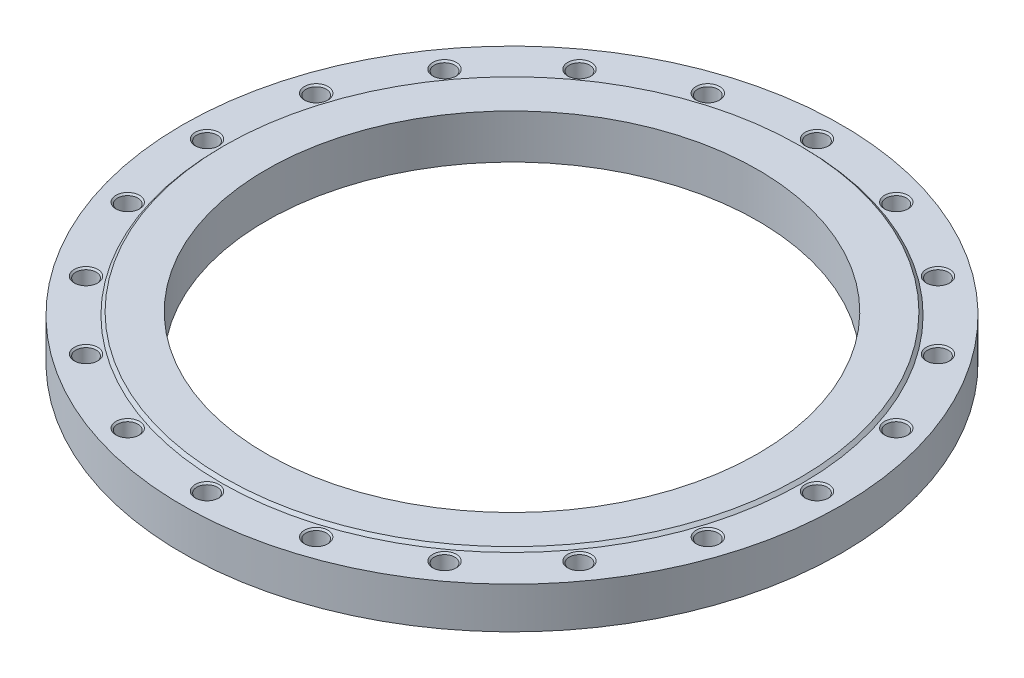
ISO-10303-21;
HEADER;
FILE_DESCRIPTION(('STEP AP214'),'2;1');
FILE_NAME('part.step','',(''),(''),'','','');
FILE_SCHEMA(('AUTOMOTIVE_DESIGN { 1 0 10303 214 1 1 1 1 }'));
ENDSEC;
DATA;
#1=APPLICATION_CONTEXT('core data for automotive mechanical design processes');
#2=APPLICATION_PROTOCOL_DEFINITION('international standard','automotive_design',2000,#1);
#3=PRODUCT_CONTEXT('',#1,'mechanical');
#4=PRODUCT('Part','Part','',(#3));
#5=PRODUCT_RELATED_PRODUCT_CATEGORY('part','',(#4));
#6=PRODUCT_DEFINITION_FORMATION('','',#4);
#7=PRODUCT_DEFINITION_CONTEXT('part definition',#1,'design');
#8=PRODUCT_DEFINITION('design','',#6,#7);
#9=PRODUCT_DEFINITION_SHAPE('','',#8);
#10=(LENGTH_UNIT() NAMED_UNIT(*) SI_UNIT(.MILLI.,.METRE.));
#11=(NAMED_UNIT(*) PLANE_ANGLE_UNIT() SI_UNIT($,.RADIAN.));
#12=(NAMED_UNIT(*) SI_UNIT($,.STERADIAN.) SOLID_ANGLE_UNIT());
#13=UNCERTAINTY_MEASURE_WITH_UNIT(LENGTH_MEASURE(1.E-05),#10,'distance_accuracy_value','');
#14=(GEOMETRIC_REPRESENTATION_CONTEXT(3) GLOBAL_UNCERTAINTY_ASSIGNED_CONTEXT((#13)) GLOBAL_UNIT_ASSIGNED_CONTEXT((#10,
#11,#12)) REPRESENTATION_CONTEXT('',''));
#15=CARTESIAN_POINT('',(0.,0.,0.));
#16=DIRECTION('',(0.,0.,1.));
#17=DIRECTION('',(1.,0.,0.));
#18=AXIS2_PLACEMENT_3D('',#15,#16,#17);
#19=CARTESIAN_POINT('',(0.,21.,0.));
#20=DIRECTION('',(0.,-1.,0.));
#21=DIRECTION('',(1.,0.,0.));
#22=AXIS2_PLACEMENT_3D('',#19,#20,#21);
#23=CYLINDRICAL_SURFACE('',#22,335.);
#24=CARTESIAN_POINT('',(0.,0.,0.));
#25=DIRECTION('',(0.,1.,0.));
#26=DIRECTION('',(1.,0.,0.));
#27=AXIS2_PLACEMENT_3D('',#24,#25,#26);
#28=CIRCLE('',#27,335.);
#29=CARTESIAN_POINT('',(335.,0.,0.));
#30=VERTEX_POINT('',#29);
#31=EDGE_CURVE('E9',#30,#30,#28,.T.);
#32=ORIENTED_EDGE('',*,*,#31,.T.);
#33=EDGE_LOOP('',(#32));
#34=FACE_BOUND('',#33,.T.);
#35=CARTESIAN_POINT('',(0.,42.,0.));
#36=DIRECTION('',(0.,1.,0.));
#37=DIRECTION('',(1.,0.,0.));
#38=AXIS2_PLACEMENT_3D('',#35,#36,#37);
#39=CIRCLE('',#38,335.);
#40=CARTESIAN_POINT('',(335.,42.,0.));
#41=VERTEX_POINT('',#40);
#42=EDGE_CURVE('E675',#41,#41,#39,.T.);
#43=ORIENTED_EDGE('',*,*,#42,.F.);
#44=EDGE_LOOP('',(#43));
#45=FACE_BOUND('',#44,.T.);
#46=ADVANCED_FACE('F15',(#34,#45),#23,.T.);
#47=CARTESIAN_POINT('',(292.5,0.,0.));
#48=DIRECTION('',(0.,-1.,0.));
#49=DIRECTION('',(-1.,0.,0.));
#50=AXIS2_PLACEMENT_3D('',#47,#48,#49);
#51=PLANE('',#50);
#52=CARTESIAN_POINT('',(0.,0.,0.));
#53=DIRECTION('',(0.,1.,0.));
#54=DIRECTION('',(1.,0.,0.));
#55=AXIS2_PLACEMENT_3D('',#52,#53,#54);
#56=CIRCLE('',#55,250.);
#57=CARTESIAN_POINT('',(250.,0.,0.));
#58=VERTEX_POINT('',#57);
#59=EDGE_CURVE('E19',#58,#58,#56,.T.);
#60=ORIENTED_EDGE('',*,*,#59,.T.);
#61=EDGE_LOOP('',(#60));
#62=FACE_BOUND('',#61,.T.);
#63=ORIENTED_EDGE('',*,*,#31,.F.);
#64=EDGE_LOOP('',(#63));
#65=FACE_BOUND('',#64,.T.);
#66=ADVANCED_FACE('F764',(#62,#65),#51,.T.);
#67=CARTESIAN_POINT('',(0.,22.5,0.));
#68=DIRECTION('',(0.,-1.,0.));
#69=DIRECTION('',(1.,0.,0.));
#70=AXIS2_PLACEMENT_3D('',#67,#68,#69);
#71=CYLINDRICAL_SURFACE('',#70,250.);
#72=CARTESIAN_POINT('',(0.,45.,0.));
#73=DIRECTION('',(0.,1.,0.));
#74=DIRECTION('',(1.,0.,0.));
#75=AXIS2_PLACEMENT_3D('',#72,#73,#74);
#76=CIRCLE('',#75,250.);
#77=CARTESIAN_POINT('',(250.,45.,0.));
#78=VERTEX_POINT('',#77);
#79=EDGE_CURVE('E544',#78,#78,#76,.T.);
#80=ORIENTED_EDGE('',*,*,#79,.T.);
#81=EDGE_LOOP('',(#80));
#82=FACE_BOUND('',#81,.T.);
#83=ORIENTED_EDGE('',*,*,#59,.F.);
#84=EDGE_LOOP('',(#83));
#85=FACE_BOUND('',#84,.T.);
#86=ADVANCED_FACE('F769',(#82,#85),#71,.F.);
#87=CARTESIAN_POINT('',(271.25,45.,0.));
#88=DIRECTION('',(0.,1.,0.));
#89=DIRECTION('',(1.,0.,0.));
#90=AXIS2_PLACEMENT_3D('',#87,#88,#89);
#91=PLANE('',#90);
#92=CARTESIAN_POINT('',(0.,45.,0.));
#93=DIRECTION('',(0.,1.,0.));
#94=DIRECTION('',(1.,0.,0.));
#95=AXIS2_PLACEMENT_3D('',#92,#93,#94);
#96=CIRCLE('',#95,292.5);
#97=CARTESIAN_POINT('',(292.5,45.,0.));
#98=VERTEX_POINT('',#97);
#99=EDGE_CURVE('E545',#98,#98,#96,.T.);
#100=ORIENTED_EDGE('',*,*,#99,.T.);
#101=EDGE_LOOP('',(#100));
#102=FACE_BOUND('',#101,.T.);
#103=ORIENTED_EDGE('',*,*,#79,.F.);
#104=EDGE_LOOP('',(#103));
#105=FACE_BOUND('',#104,.T.);
#106=ADVANCED_FACE('F838',(#102,#105),#91,.T.);
#107=CARTESIAN_POINT('',(0.,43.5,0.));
#108=DIRECTION('',(0.,-1.,0.));
#109=DIRECTION('',(1.,0.,0.));
#110=AXIS2_PLACEMENT_3D('',#107,#108,#109);
#111=CONICAL_SURFACE('',#110,294.,0.78539816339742);
#112=CARTESIAN_POINT('',(0.,42.,0.));
#113=DIRECTION('',(0.,1.,0.));
#114=DIRECTION('',(1.,0.,0.));
#115=AXIS2_PLACEMENT_3D('',#112,#113,#114);
#116=CIRCLE('',#115,295.5);
#117=CARTESIAN_POINT('',(295.5,42.,0.));
#118=VERTEX_POINT('',#117);
#119=EDGE_CURVE('E677',#118,#118,#116,.T.);
#120=ORIENTED_EDGE('',*,*,#119,.T.);
#121=EDGE_LOOP('',(#120));
#122=FACE_BOUND('',#121,.T.);
#123=ORIENTED_EDGE('',*,*,#99,.F.);
#124=EDGE_LOOP('',(#123));
#125=FACE_BOUND('',#124,.T.);
#126=ADVANCED_FACE('F717',(#122,#125),#111,.T.);
#127=CARTESIAN_POINT('',(315.25,42.,0.));
#128=DIRECTION('',(0.,1.,0.));
#129=DIRECTION('',(1.,0.,0.));
#130=AXIS2_PLACEMENT_3D('',#127,#128,#129);
#131=PLANE('',#130);
#132=ORIENTED_EDGE('',*,*,#42,.T.);
#133=EDGE_LOOP('',(#132));
#134=FACE_BOUND('',#133,.T.);
#135=ORIENTED_EDGE('',*,*,#119,.F.);
#136=EDGE_LOOP('',(#135));
#137=FACE_BOUND('',#136,.T.);
#138=CARTESIAN_POINT('',(310.,42.,0.));
#139=DIRECTION('',(0.,-1.,0.));
#140=DIRECTION('',(1.,0.,0.));
#141=AXIS2_PLACEMENT_3D('',#138,#139,#140);
#142=CIRCLE('',#141,12.);
#143=CARTESIAN_POINT('',(322.,42.,0.));
#144=VERTEX_POINT('',#143);
#145=EDGE_CURVE('E658',#144,#144,#142,.T.);
#146=ORIENTED_EDGE('',*,*,#145,.T.);
#147=EDGE_LOOP('',(#146));
#148=FACE_BOUND('',#147,.T.);
#149=CARTESIAN_POINT('',(294.827520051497,42.,-95.7952682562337));
#150=DIRECTION('',(0.,-1.,0.));
#151=DIRECTION('',(0.951056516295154,0.,-0.309016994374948));
#152=AXIS2_PLACEMENT_3D('',#149,#150,#151);
#153=CIRCLE('',#152,12.);
#154=CARTESIAN_POINT('',(306.24019824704,42.,-99.503472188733));
#155=VERTEX_POINT('',#154);
#156=EDGE_CURVE('E465',#155,#155,#153,.T.);
#157=ORIENTED_EDGE('',*,*,#156,.T.);
#158=EDGE_LOOP('',(#157));
#159=FACE_BOUND('',#158,.T.);
#160=CARTESIAN_POINT('',(250.795268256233,42.,-182.213428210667));
#161=DIRECTION('',(0.,-1.,0.));
#162=DIRECTION('',(0.809016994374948,0.,-0.587785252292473));
#163=AXIS2_PLACEMENT_3D('',#160,#161,#162);
#164=CIRCLE('',#163,12.);
#165=CARTESIAN_POINT('',(260.503472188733,42.,-189.266851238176));
#166=VERTEX_POINT('',#165);
#167=EDGE_CURVE('E513',#166,#166,#164,.T.);
#168=ORIENTED_EDGE('',*,*,#167,.T.);
#169=EDGE_LOOP('',(#168));
#170=FACE_BOUND('',#169,.T.);
#171=CARTESIAN_POINT('',(182.213428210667,42.,-250.795268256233));
#172=DIRECTION('',(0.,-1.,0.));
#173=DIRECTION('',(0.587785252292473,0.,-0.809016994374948));
#174=AXIS2_PLACEMENT_3D('',#171,#172,#173);
#175=CIRCLE('',#174,12.);
#176=CARTESIAN_POINT('',(189.266851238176,42.,-260.503472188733));
#177=VERTEX_POINT('',#176);
#178=EDGE_CURVE('E669',#177,#177,#175,.T.);
#179=ORIENTED_EDGE('',*,*,#178,.T.);
#180=EDGE_LOOP('',(#179));
#181=FACE_BOUND('',#180,.T.);
#182=CARTESIAN_POINT('',(95.7952682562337,42.,-294.827520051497));
#183=DIRECTION('',(0.,-1.,0.));
#184=DIRECTION('',(0.309016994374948,0.,-0.951056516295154));
#185=AXIS2_PLACEMENT_3D('',#182,#183,#184);
#186=CIRCLE('',#185,12.);
#187=CARTESIAN_POINT('',(99.5034721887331,42.,-306.24019824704));
#188=VERTEX_POINT('',#187);
#189=EDGE_CURVE('E614',#188,#188,#186,.T.);
#190=ORIENTED_EDGE('',*,*,#189,.T.);
#191=EDGE_LOOP('',(#190));
#192=FACE_BOUND('',#191,.T.);
#193=CARTESIAN_POINT('',(0.,42.,-310.));
#194=DIRECTION('',(0.,-1.,0.));
#195=DIRECTION('',(0.,0.,-1.));
#196=AXIS2_PLACEMENT_3D('',#193,#194,#195);
#197=CIRCLE('',#196,12.);
#198=CARTESIAN_POINT('',(0.,42.,-322.));
#199=VERTEX_POINT('',#198);
#200=EDGE_CURVE('E551',#199,#199,#197,.T.);
#201=ORIENTED_EDGE('',*,*,#200,.T.);
#202=EDGE_LOOP('',(#201));
#203=FACE_BOUND('',#202,.T.);
#204=CARTESIAN_POINT('',(-95.7952682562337,42.,-294.827520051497));
#205=DIRECTION('',(0.,-1.,0.));
#206=DIRECTION('',(-0.309016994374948,0.,-0.951056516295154));
#207=AXIS2_PLACEMENT_3D('',#204,#205,#206);
#208=CIRCLE('',#207,12.);
#209=CARTESIAN_POINT('',(-99.503472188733,42.,-306.24019824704));
#210=VERTEX_POINT('',#209);
#211=EDGE_CURVE('E695',#210,#210,#208,.T.);
#212=ORIENTED_EDGE('',*,*,#211,.T.);
#213=EDGE_LOOP('',(#212));
#214=FACE_BOUND('',#213,.T.);
#215=CARTESIAN_POINT('',(-182.213428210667,42.,-250.795268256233));
#216=DIRECTION('',(0.,-1.,0.));
#217=DIRECTION('',(-0.587785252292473,0.,-0.809016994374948));
#218=AXIS2_PLACEMENT_3D('',#215,#216,#217);
#219=CIRCLE('',#218,12.);
#220=CARTESIAN_POINT('',(-189.266851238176,42.,-260.503472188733));
#221=VERTEX_POINT('',#220);
#222=EDGE_CURVE('E494',#221,#221,#219,.T.);
#223=ORIENTED_EDGE('',*,*,#222,.T.);
#224=EDGE_LOOP('',(#223));
#225=FACE_BOUND('',#224,.T.);
#226=CARTESIAN_POINT('',(-250.795268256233,42.,-182.213428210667));
#227=DIRECTION('',(0.,-1.,0.));
#228=DIRECTION('',(-0.809016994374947,0.,-0.587785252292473));
#229=AXIS2_PLACEMENT_3D('',#226,#227,#228);
#230=CIRCLE('',#229,12.);
#231=CARTESIAN_POINT('',(-260.503472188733,42.,-189.266851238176));
#232=VERTEX_POINT('',#231);
#233=EDGE_CURVE('E671',#232,#232,#230,.T.);
#234=ORIENTED_EDGE('',*,*,#233,.T.);
#235=EDGE_LOOP('',(#234));
#236=FACE_BOUND('',#235,.T.);
#237=CARTESIAN_POINT('',(-294.827520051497,42.,-95.7952682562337));
#238=DIRECTION('',(0.,-1.,0.));
#239=DIRECTION('',(-0.951056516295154,0.,-0.309016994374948));
#240=AXIS2_PLACEMENT_3D('',#237,#238,#239);
#241=CIRCLE('',#240,12.);
#242=CARTESIAN_POINT('',(-306.24019824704,42.,-99.5034721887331));
#243=VERTEX_POINT('',#242);
#244=EDGE_CURVE('E573',#243,#243,#241,.T.);
#245=ORIENTED_EDGE('',*,*,#244,.T.);
#246=EDGE_LOOP('',(#245));
#247=FACE_BOUND('',#246,.T.);
#248=CARTESIAN_POINT('',(-310.,42.,0.));
#249=DIRECTION('',(0.,-1.,0.));
#250=DIRECTION('',(-1.,0.,0.));
#251=AXIS2_PLACEMENT_3D('',#248,#249,#250);
#252=CIRCLE('',#251,12.);
#253=CARTESIAN_POINT('',(-322.,42.,0.));
#254=VERTEX_POINT('',#253);
#255=EDGE_CURVE('E624',#254,#254,#252,.T.);
#256=ORIENTED_EDGE('',*,*,#255,.T.);
#257=EDGE_LOOP('',(#256));
#258=FACE_BOUND('',#257,.T.);
#259=CARTESIAN_POINT('',(-294.827520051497,42.,95.7952682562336));
#260=DIRECTION('',(0.,-1.,0.));
#261=DIRECTION('',(-0.951056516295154,0.,0.309016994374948));
#262=AXIS2_PLACEMENT_3D('',#259,#260,#261);
#263=CIRCLE('',#262,12.);
#264=CARTESIAN_POINT('',(-306.24019824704,42.,99.503472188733));
#265=VERTEX_POINT('',#264);
#266=EDGE_CURVE('E648',#265,#265,#263,.T.);
#267=ORIENTED_EDGE('',*,*,#266,.T.);
#268=EDGE_LOOP('',(#267));
#269=FACE_BOUND('',#268,.T.);
#270=CARTESIAN_POINT('',(-250.795268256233,42.,182.213428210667));
#271=DIRECTION('',(0.,-1.,0.));
#272=DIRECTION('',(-0.809016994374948,0.,0.587785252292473));
#273=AXIS2_PLACEMENT_3D('',#270,#271,#272);
#274=CIRCLE('',#273,12.);
#275=CARTESIAN_POINT('',(-260.503472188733,42.,189.266851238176));
#276=VERTEX_POINT('',#275);
#277=EDGE_CURVE('E634',#276,#276,#274,.T.);
#278=ORIENTED_EDGE('',*,*,#277,.T.);
#279=EDGE_LOOP('',(#278));
#280=FACE_BOUND('',#279,.T.);
#281=CARTESIAN_POINT('',(-182.213428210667,42.,250.795268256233));
#282=DIRECTION('',(0.,-1.,0.));
#283=DIRECTION('',(-0.587785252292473,0.,0.809016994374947));
#284=AXIS2_PLACEMENT_3D('',#281,#282,#283);
#285=CIRCLE('',#284,12.);
#286=CARTESIAN_POINT('',(-189.266851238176,42.,260.503472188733));
#287=VERTEX_POINT('',#286);
#288=EDGE_CURVE('E523',#287,#287,#285,.T.);
#289=ORIENTED_EDGE('',*,*,#288,.T.);
#290=EDGE_LOOP('',(#289));
#291=FACE_BOUND('',#290,.T.);
#292=CARTESIAN_POINT('',(-95.7952682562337,42.,294.827520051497));
#293=DIRECTION('',(0.,-1.,0.));
#294=DIRECTION('',(-0.309016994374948,0.,0.951056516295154));
#295=AXIS2_PLACEMENT_3D('',#292,#293,#294);
#296=CIRCLE('',#295,12.);
#297=CARTESIAN_POINT('',(-99.5034721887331,42.,306.24019824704));
#298=VERTEX_POINT('',#297);
#299=EDGE_CURVE('E598',#298,#298,#296,.T.);
#300=ORIENTED_EDGE('',*,*,#299,.T.);
#301=EDGE_LOOP('',(#300));
#302=FACE_BOUND('',#301,.T.);
#303=CARTESIAN_POINT('',(0.,42.,310.));
#304=DIRECTION('',(0.,-1.,0.));
#305=DIRECTION('',(0.,0.,1.));
#306=AXIS2_PLACEMENT_3D('',#303,#304,#305);
#307=CIRCLE('',#306,12.);
#308=CARTESIAN_POINT('',(0.,42.,322.));
#309=VERTEX_POINT('',#308);
#310=EDGE_CURVE('E577',#309,#309,#307,.T.);
#311=ORIENTED_EDGE('',*,*,#310,.T.);
#312=EDGE_LOOP('',(#311));
#313=FACE_BOUND('',#312,.T.);
#314=CARTESIAN_POINT('',(95.7952682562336,42.,294.827520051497));
#315=DIRECTION('',(0.,-1.,0.));
#316=DIRECTION('',(0.309016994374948,0.,0.951056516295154));
#317=AXIS2_PLACEMENT_3D('',#314,#315,#316);
#318=CIRCLE('',#317,12.);
#319=CARTESIAN_POINT('',(99.503472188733,42.,306.24019824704));
#320=VERTEX_POINT('',#319);
#321=EDGE_CURVE('E560',#320,#320,#318,.T.);
#322=ORIENTED_EDGE('',*,*,#321,.T.);
#323=EDGE_LOOP('',(#322));
#324=FACE_BOUND('',#323,.T.);
#325=CARTESIAN_POINT('',(182.213428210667,42.,250.795268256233));
#326=DIRECTION('',(0.,-1.,0.));
#327=DIRECTION('',(0.587785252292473,0.,0.809016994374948));
#328=AXIS2_PLACEMENT_3D('',#325,#326,#327);
#329=CIRCLE('',#328,12.);
#330=CARTESIAN_POINT('',(189.266851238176,42.,260.503472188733));
#331=VERTEX_POINT('',#330);
#332=EDGE_CURVE('E538',#331,#331,#329,.T.);
#333=ORIENTED_EDGE('',*,*,#332,.T.);
#334=EDGE_LOOP('',(#333));
#335=FACE_BOUND('',#334,.T.);
#336=CARTESIAN_POINT('',(250.795268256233,42.,182.213428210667));
#337=DIRECTION('',(0.,-1.,0.));
#338=DIRECTION('',(0.809016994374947,0.,0.587785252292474));
#339=AXIS2_PLACEMENT_3D('',#336,#337,#338);
#340=CIRCLE('',#339,12.);
#341=CARTESIAN_POINT('',(260.503472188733,42.,189.266851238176));
#342=VERTEX_POINT('',#341);
#343=EDGE_CURVE('E478',#342,#342,#340,.T.);
#344=ORIENTED_EDGE('',*,*,#343,.T.);
#345=EDGE_LOOP('',(#344));
#346=FACE_BOUND('',#345,.T.);
#347=CARTESIAN_POINT('',(294.827520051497,42.,95.7952682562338));
#348=DIRECTION('',(0.,-1.,0.));
#349=DIRECTION('',(0.951056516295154,0.,0.309016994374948));
#350=AXIS2_PLACEMENT_3D('',#347,#348,#349);
#351=CIRCLE('',#350,12.);
#352=CARTESIAN_POINT('',(306.24019824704,42.,99.5034721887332));
#353=VERTEX_POINT('',#352);
#354=EDGE_CURVE('E490',#353,#353,#351,.T.);
#355=ORIENTED_EDGE('',*,*,#354,.T.);
#356=EDGE_LOOP('',(#355));
#357=FACE_BOUND('',#356,.T.);
#358=ADVANCED_FACE('F466',(#134,#137,#148,#159,#170,#181,#192,#203,#214,#225,#236,#247,#258,
#269,#280,#291,#302,#313,#324,#335,#346,#357),#131,.T.);
#359=CARTESIAN_POINT('',(310.,6.00463463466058,0.));
#360=DIRECTION('',(0.,1.,0.));
#361=DIRECTION('',(1.,0.,0.));
#362=AXIS2_PLACEMENT_3D('',#359,#360,#361);
#363=CONICAL_SURFACE('',#362,5.188125,1.0471975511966);
#364=CARTESIAN_POINT('',(310.,9.,0.));
#365=DIRECTION('',(0.,-1.,0.));
#366=DIRECTION('',(1.,0.,0.));
#367=AXIS2_PLACEMENT_3D('',#364,#365,#366);
#368=CIRCLE('',#367,10.37625);
#369=CARTESIAN_POINT('',(320.37625,9.,0.));
#370=VERTEX_POINT('',#369);
#371=EDGE_CURVE('E582',#370,#370,#368,.T.);
#372=ORIENTED_EDGE('',*,*,#371,.F.);
#373=EDGE_LOOP('',(#372));
#374=FACE_BOUND('',#373,.T.);
#375=CARTESIAN_POINT('',(310.,3.00926926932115,0.));
#376=VERTEX_POINT('',#375);
#377=VERTEX_LOOP('',#376);
#378=FACE_BOUND('',#377,.T.);
#379=ADVANCED_FACE('F722',(#374,#378),#363,.F.);
#380=CARTESIAN_POINT('',(310.,12.688125,0.));
#381=DIRECTION('',(0.,1.,0.));
#382=DIRECTION('',(1.,0.,0.));
#383=AXIS2_PLACEMENT_3D('',#380,#381,#382);
#384=CYLINDRICAL_SURFACE('',#383,10.37625);
#385=CARTESIAN_POINT('',(310.,16.37625,0.));
#386=DIRECTION('',(0.,-1.,0.));
#387=DIRECTION('',(1.,0.,0.));
#388=AXIS2_PLACEMENT_3D('',#385,#386,#387);
#389=CIRCLE('',#388,10.37625);
#390=CARTESIAN_POINT('',(320.37625,16.37625,0.));
#391=VERTEX_POINT('',#390);
#392=EDGE_CURVE('E580',#391,#391,#389,.T.);
#393=ORIENTED_EDGE('',*,*,#392,.F.);
#394=EDGE_LOOP('',(#393));
#395=FACE_BOUND('',#394,.T.);
#396=ORIENTED_EDGE('',*,*,#371,.T.);
#397=EDGE_LOOP('',(#396));
#398=FACE_BOUND('',#397,.T.);
#399=ADVANCED_FACE('F747',(#395,#398),#384,.F.);
#400=CARTESIAN_POINT('',(310.,17.188125,0.));
#401=DIRECTION('',(0.,1.,0.));
#402=DIRECTION('',(1.,0.,0.));
#403=AXIS2_PLACEMENT_3D('',#400,#401,#402);
#404=CONICAL_SURFACE('',#403,11.188125,0.785398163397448);
#405=CARTESIAN_POINT('',(310.,18.,0.));
#406=DIRECTION('',(0.,-1.,0.));
#407=DIRECTION('',(1.,0.,0.));
#408=AXIS2_PLACEMENT_3D('',#405,#406,#407);
#409=CIRCLE('',#408,12.);
#410=CARTESIAN_POINT('',(322.,18.,0.));
#411=VERTEX_POINT('',#410);
#412=EDGE_CURVE('E583',#411,#411,#409,.T.);
#413=ORIENTED_EDGE('',*,*,#412,.F.);
#414=EDGE_LOOP('',(#413));
#415=FACE_BOUND('',#414,.T.);
#416=ORIENTED_EDGE('',*,*,#392,.T.);
#417=EDGE_LOOP('',(#416));
#418=FACE_BOUND('',#417,.T.);
#419=ADVANCED_FACE('F17',(#415,#418),#404,.F.);
#420=CARTESIAN_POINT('',(321.188125,18.,0.));
#421=DIRECTION('',(0.,1.,0.));
#422=DIRECTION('',(-1.,0.,0.));
#423=AXIS2_PLACEMENT_3D('',#420,#421,#422);
#424=PLANE('',#423);
#425=CARTESIAN_POINT('',(310.,18.,0.));
#426=DIRECTION('',(0.,-1.,0.));
#427=DIRECTION('',(1.,0.,0.));
#428=AXIS2_PLACEMENT_3D('',#425,#426,#427);
#429=CIRCLE('',#428,10.37625);
#430=CARTESIAN_POINT('',(320.37625,18.,0.));
#431=VERTEX_POINT('',#430);
#432=EDGE_CURVE('E644',#431,#431,#429,.T.);
#433=ORIENTED_EDGE('',*,*,#432,.F.);
#434=EDGE_LOOP('',(#433));
#435=FACE_BOUND('',#434,.T.);
#436=ORIENTED_EDGE('',*,*,#412,.T.);
#437=EDGE_LOOP('',(#436));
#438=FACE_BOUND('',#437,.T.);
#439=ADVANCED_FACE('F737',(#435,#438),#424,.F.);
#440=CARTESIAN_POINT('',(310.,29.188125,0.));
#441=DIRECTION('',(0.,1.,0.));
#442=DIRECTION('',(1.,0.,0.));
#443=AXIS2_PLACEMENT_3D('',#440,#441,#442);
#444=CYLINDRICAL_SURFACE('',#443,10.37625);
#445=CARTESIAN_POINT('',(310.,40.37625,0.));
#446=DIRECTION('',(0.,-1.,0.));
#447=DIRECTION('',(1.,0.,0.));
#448=AXIS2_PLACEMENT_3D('',#445,#446,#447);
#449=CIRCLE('',#448,10.37625);
#450=CARTESIAN_POINT('',(320.37625,40.37625,0.));
#451=VERTEX_POINT('',#450);
#452=EDGE_CURVE('E656',#451,#451,#449,.T.);
#453=ORIENTED_EDGE('',*,*,#452,.F.);
#454=EDGE_LOOP('',(#453));
#455=FACE_BOUND('',#454,.T.);
#456=ORIENTED_EDGE('',*,*,#432,.T.);
#457=EDGE_LOOP('',(#456));
#458=FACE_BOUND('',#457,.T.);
#459=ADVANCED_FACE('F731',(#455,#458),#444,.F.);
#460=CARTESIAN_POINT('',(310.,41.188125,0.));
#461=DIRECTION('',(0.,1.,0.));
#462=DIRECTION('',(1.,0.,0.));
#463=AXIS2_PLACEMENT_3D('',#460,#461,#462);
#464=CONICAL_SURFACE('',#463,11.188125,0.785398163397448);
#465=ORIENTED_EDGE('',*,*,#145,.F.);
#466=EDGE_LOOP('',(#465));
#467=FACE_BOUND('',#466,.T.);
#468=ORIENTED_EDGE('',*,*,#452,.T.);
#469=EDGE_LOOP('',(#468));
#470=FACE_BOUND('',#469,.T.);
#471=ADVANCED_FACE('F727',(#467,#470),#464,.F.);
#472=CARTESIAN_POINT('',(294.827520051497,6.00463463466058,-95.7952682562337));
#473=DIRECTION('',(0.,1.,0.));
#474=DIRECTION('',(0.951056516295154,0.,-0.309016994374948));
#475=AXIS2_PLACEMENT_3D('',#472,#473,#474);
#476=CONICAL_SURFACE('',#475,5.188125,1.0471975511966);
#477=CARTESIAN_POINT('',(294.827520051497,9.,-95.7952682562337));
#478=DIRECTION('',(0.,-1.,0.));
#479=DIRECTION('',(0.951056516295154,0.,-0.309016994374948));
#480=AXIS2_PLACEMENT_3D('',#477,#478,#479);
#481=CIRCLE('',#480,10.37625);
#482=CARTESIAN_POINT('',(304.695920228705,9.,-99.0017058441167));
#483=VERTEX_POINT('',#482);
#484=EDGE_CURVE('E659',#483,#483,#481,.T.);
#485=ORIENTED_EDGE('',*,*,#484,.F.);
#486=EDGE_LOOP('',(#485));
#487=FACE_BOUND('',#486,.T.);
#488=CARTESIAN_POINT('',(294.827520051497,3.00926926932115,-95.7952682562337));
#489=VERTEX_POINT('',#488);
#490=VERTEX_LOOP('',#489);
#491=FACE_BOUND('',#490,.T.);
#492=ADVANCED_FACE('F730',(#487,#491),#476,.F.);
#493=CARTESIAN_POINT('',(294.827520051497,12.688125,-95.7952682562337));
#494=DIRECTION('',(0.,1.,0.));
#495=DIRECTION('',(0.951056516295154,0.,-0.309016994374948));
#496=AXIS2_PLACEMENT_3D('',#493,#494,#495);
#497=CYLINDRICAL_SURFACE('',#496,10.37625);
#498=CARTESIAN_POINT('',(294.827520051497,16.37625,-95.7952682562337));
#499=DIRECTION('',(0.,-1.,0.));
#500=DIRECTION('',(0.951056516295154,0.,-0.309016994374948));
#501=AXIS2_PLACEMENT_3D('',#498,#499,#500);
#502=CIRCLE('',#501,10.37625);
#503=CARTESIAN_POINT('',(304.695920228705,16.37625,-99.0017058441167));
#504=VERTEX_POINT('',#503);
#505=EDGE_CURVE('E636',#504,#504,#502,.T.);
#506=ORIENTED_EDGE('',*,*,#505,.F.);
#507=EDGE_LOOP('',(#506));
#508=FACE_BOUND('',#507,.T.);
#509=ORIENTED_EDGE('',*,*,#484,.T.);
#510=EDGE_LOOP('',(#509));
#511=FACE_BOUND('',#510,.T.);
#512=ADVANCED_FACE('F813',(#508,#511),#497,.F.);
#513=CARTESIAN_POINT('',(294.827520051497,17.188125,-95.7952682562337));
#514=DIRECTION('',(0.,1.,0.));
#515=DIRECTION('',(0.951056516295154,0.,-0.309016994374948));
#516=AXIS2_PLACEMENT_3D('',#513,#514,#515);
#517=CONICAL_SURFACE('',#516,11.188125,0.785398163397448);
#518=CARTESIAN_POINT('',(294.827520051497,18.,-95.7952682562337));
#519=DIRECTION('',(0.,-1.,0.));
#520=DIRECTION('',(0.951056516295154,0.,-0.309016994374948));
#521=AXIS2_PLACEMENT_3D('',#518,#519,#520);
#522=CIRCLE('',#521,12.);
#523=CARTESIAN_POINT('',(306.24019824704,18.,-99.503472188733));
#524=VERTEX_POINT('',#523);
#525=EDGE_CURVE('E472',#524,#524,#522,.T.);
#526=ORIENTED_EDGE('',*,*,#525,.F.);
#527=EDGE_LOOP('',(#526));
#528=FACE_BOUND('',#527,.T.);
#529=ORIENTED_EDGE('',*,*,#505,.T.);
#530=EDGE_LOOP('',(#529));
#531=FACE_BOUND('',#530,.T.);
#532=ADVANCED_FACE('F1140',(#528,#531),#517,.F.);
#533=CARTESIAN_POINT('',(305.468059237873,18.,-99.2525890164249));
#534=DIRECTION('',(0.,1.,0.));
#535=DIRECTION('',(-0.951056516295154,0.,0.309016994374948));
#536=AXIS2_PLACEMENT_3D('',#533,#534,#535);
#537=PLANE('',#536);
#538=CARTESIAN_POINT('',(294.827520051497,18.,-95.7952682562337));
#539=DIRECTION('',(0.,-1.,0.));
#540=DIRECTION('',(0.951056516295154,0.,-0.309016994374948));
#541=AXIS2_PLACEMENT_3D('',#538,#539,#540);
#542=CIRCLE('',#541,10.37625);
#543=CARTESIAN_POINT('',(304.695920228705,18.,-99.0017058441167));
#544=VERTEX_POINT('',#543);
#545=EDGE_CURVE('E469',#544,#544,#542,.T.);
#546=ORIENTED_EDGE('',*,*,#545,.F.);
#547=EDGE_LOOP('',(#546));
#548=FACE_BOUND('',#547,.T.);
#549=ORIENTED_EDGE('',*,*,#525,.T.);
#550=EDGE_LOOP('',(#549));
#551=FACE_BOUND('',#550,.T.);
#552=ADVANCED_FACE('F1143',(#548,#551),#537,.F.);
#553=CARTESIAN_POINT('',(294.827520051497,29.188125,-95.7952682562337));
#554=DIRECTION('',(0.,1.,0.));
#555=DIRECTION('',(0.951056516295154,0.,-0.309016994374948));
#556=AXIS2_PLACEMENT_3D('',#553,#554,#555);
#557=CYLINDRICAL_SURFACE('',#556,10.37625);
#558=CARTESIAN_POINT('',(294.827520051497,40.37625,-95.7952682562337));
#559=DIRECTION('',(0.,-1.,0.));
#560=DIRECTION('',(0.951056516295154,0.,-0.309016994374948));
#561=AXIS2_PLACEMENT_3D('',#558,#559,#560);
#562=CIRCLE('',#561,10.37625);
#563=CARTESIAN_POINT('',(304.695920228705,40.37625,-99.0017058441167));
#564=VERTEX_POINT('',#563);
#565=EDGE_CURVE('E470',#564,#564,#562,.T.);
#566=ORIENTED_EDGE('',*,*,#565,.F.);
#567=EDGE_LOOP('',(#566));
#568=FACE_BOUND('',#567,.T.);
#569=ORIENTED_EDGE('',*,*,#545,.T.);
#570=EDGE_LOOP('',(#569));
#571=FACE_BOUND('',#570,.T.);
#572=ADVANCED_FACE('F1139',(#568,#571),#557,.F.);
#573=CARTESIAN_POINT('',(294.827520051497,41.188125,-95.7952682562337));
#574=DIRECTION('',(0.,1.,0.));
#575=DIRECTION('',(0.951056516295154,0.,-0.309016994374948));
#576=AXIS2_PLACEMENT_3D('',#573,#574,#575);
#577=CONICAL_SURFACE('',#576,11.188125,0.785398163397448);
#578=ORIENTED_EDGE('',*,*,#156,.F.);
#579=EDGE_LOOP('',(#578));
#580=FACE_BOUND('',#579,.T.);
#581=ORIENTED_EDGE('',*,*,#565,.T.);
#582=EDGE_LOOP('',(#581));
#583=FACE_BOUND('',#582,.T.);
#584=ADVANCED_FACE('F1017',(#580,#583),#577,.F.);
#585=CARTESIAN_POINT('',(250.795268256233,6.00463463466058,-182.213428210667));
#586=DIRECTION('',(0.,1.,0.));
#587=DIRECTION('',(0.809016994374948,0.,-0.587785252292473));
#588=AXIS2_PLACEMENT_3D('',#585,#586,#587);
#589=CONICAL_SURFACE('',#588,5.188125,1.0471975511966);
#590=CARTESIAN_POINT('',(250.795268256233,9.,-182.213428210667));
#591=DIRECTION('',(0.,-1.,0.));
#592=DIRECTION('',(0.809016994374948,0.,-0.587785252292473));
#593=AXIS2_PLACEMENT_3D('',#590,#591,#592);
#594=CIRCLE('',#593,10.37625);
#595=CARTESIAN_POINT('',(259.189830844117,9.,-188.312434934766));
#596=VERTEX_POINT('',#595);
#597=EDGE_CURVE('E474',#596,#596,#594,.T.);
#598=ORIENTED_EDGE('',*,*,#597,.F.);
#599=EDGE_LOOP('',(#598));
#600=FACE_BOUND('',#599,.T.);
#601=CARTESIAN_POINT('',(250.795268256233,3.00926926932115,-182.213428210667));
#602=VERTEX_POINT('',#601);
#603=VERTEX_LOOP('',#602);
#604=FACE_BOUND('',#603,.T.);
#605=ADVANCED_FACE('F1013',(#600,#604),#589,.F.);
#606=CARTESIAN_POINT('',(250.795268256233,12.688125,-182.213428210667));
#607=DIRECTION('',(0.,1.,0.));
#608=DIRECTION('',(0.809016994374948,0.,-0.587785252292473));
#609=AXIS2_PLACEMENT_3D('',#606,#607,#608);
#610=CYLINDRICAL_SURFACE('',#609,10.37625);
#611=CARTESIAN_POINT('',(250.795268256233,16.37625,-182.213428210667));
#612=DIRECTION('',(0.,-1.,0.));
#613=DIRECTION('',(0.809016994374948,0.,-0.587785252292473));
#614=AXIS2_PLACEMENT_3D('',#611,#612,#613);
#615=CIRCLE('',#614,10.37625);
#616=CARTESIAN_POINT('',(259.189830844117,16.37625,-188.312434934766));
#617=VERTEX_POINT('',#616);
#618=EDGE_CURVE('E501',#617,#617,#615,.T.);
#619=ORIENTED_EDGE('',*,*,#618,.F.);
#620=EDGE_LOOP('',(#619));
#621=FACE_BOUND('',#620,.T.);
#622=ORIENTED_EDGE('',*,*,#597,.T.);
#623=EDGE_LOOP('',(#622));
#624=FACE_BOUND('',#623,.T.);
#625=ADVANCED_FACE('F1016',(#621,#624),#610,.F.);
#626=CARTESIAN_POINT('',(250.795268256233,17.188125,-182.213428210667));
#627=DIRECTION('',(0.,1.,0.));
#628=DIRECTION('',(0.809016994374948,0.,-0.587785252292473));
#629=AXIS2_PLACEMENT_3D('',#626,#627,#628);
#630=CONICAL_SURFACE('',#629,11.188125,0.785398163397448);
#631=CARTESIAN_POINT('',(250.795268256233,18.,-182.213428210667));
#632=DIRECTION('',(0.,-1.,0.));
#633=DIRECTION('',(0.809016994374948,0.,-0.587785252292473));
#634=AXIS2_PLACEMENT_3D('',#631,#632,#633);
#635=CIRCLE('',#634,12.);
#636=CARTESIAN_POINT('',(260.503472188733,18.,-189.266851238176));
#637=VERTEX_POINT('',#636);
#638=EDGE_CURVE('E499',#637,#637,#635,.T.);
#639=ORIENTED_EDGE('',*,*,#638,.F.);
#640=EDGE_LOOP('',(#639));
#641=FACE_BOUND('',#640,.T.);
#642=ORIENTED_EDGE('',*,*,#618,.T.);
#643=EDGE_LOOP('',(#642));
#644=FACE_BOUND('',#643,.T.);
#645=ADVANCED_FACE('F862',(#641,#644),#630,.F.);
#646=CARTESIAN_POINT('',(259.846651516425,18.,-188.789643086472));
#647=DIRECTION('',(0.,1.,0.));
#648=DIRECTION('',(-0.809016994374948,0.,0.587785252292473));
#649=AXIS2_PLACEMENT_3D('',#646,#647,#648);
#650=PLANE('',#649);
#651=CARTESIAN_POINT('',(250.795268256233,18.,-182.213428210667));
#652=DIRECTION('',(0.,-1.,0.));
#653=DIRECTION('',(0.809016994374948,0.,-0.587785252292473));
#654=AXIS2_PLACEMENT_3D('',#651,#652,#653);
#655=CIRCLE('',#654,10.37625);
#656=CARTESIAN_POINT('',(259.189830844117,18.,-188.312434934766));
#657=VERTEX_POINT('',#656);
#658=EDGE_CURVE('E502',#657,#657,#655,.T.);
#659=ORIENTED_EDGE('',*,*,#658,.F.);
#660=EDGE_LOOP('',(#659));
#661=FACE_BOUND('',#660,.T.);
#662=ORIENTED_EDGE('',*,*,#638,.T.);
#663=EDGE_LOOP('',(#662));
#664=FACE_BOUND('',#663,.T.);
#665=ADVANCED_FACE('F858',(#661,#664),#650,.F.);
#666=CARTESIAN_POINT('',(250.795268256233,29.188125,-182.213428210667));
#667=DIRECTION('',(0.,1.,0.));
#668=DIRECTION('',(0.809016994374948,0.,-0.587785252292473));
#669=AXIS2_PLACEMENT_3D('',#666,#667,#668);
#670=CYLINDRICAL_SURFACE('',#669,10.37625);
#671=CARTESIAN_POINT('',(250.795268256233,40.37625,-182.213428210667));
#672=DIRECTION('',(0.,-1.,0.));
#673=DIRECTION('',(0.809016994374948,0.,-0.587785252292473));
#674=AXIS2_PLACEMENT_3D('',#671,#672,#673);
#675=CIRCLE('',#674,10.37625);
#676=CARTESIAN_POINT('',(259.189830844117,40.37625,-188.312434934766));
#677=VERTEX_POINT('',#676);
#678=EDGE_CURVE('E681',#677,#677,#675,.T.);
#679=ORIENTED_EDGE('',*,*,#678,.F.);
#680=EDGE_LOOP('',(#679));
#681=FACE_BOUND('',#680,.T.);
#682=ORIENTED_EDGE('',*,*,#658,.T.);
#683=EDGE_LOOP('',(#682));
#684=FACE_BOUND('',#683,.T.);
#685=ADVANCED_FACE('F861',(#681,#684),#670,.F.);
#686=CARTESIAN_POINT('',(250.795268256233,41.188125,-182.213428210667));
#687=DIRECTION('',(0.,1.,0.));
#688=DIRECTION('',(0.809016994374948,0.,-0.587785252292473));
#689=AXIS2_PLACEMENT_3D('',#686,#687,#688);
#690=CONICAL_SURFACE('',#689,11.188125,0.785398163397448);
#691=ORIENTED_EDGE('',*,*,#167,.F.);
#692=EDGE_LOOP('',(#691));
#693=FACE_BOUND('',#692,.T.);
#694=ORIENTED_EDGE('',*,*,#678,.T.);
#695=EDGE_LOOP('',(#694));
#696=FACE_BOUND('',#695,.T.);
#697=ADVANCED_FACE('F886',(#693,#696),#690,.F.);
#698=CARTESIAN_POINT('',(182.213428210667,6.00463463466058,-250.795268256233));
#699=DIRECTION('',(0.,1.,0.));
#700=DIRECTION('',(0.587785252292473,0.,-0.809016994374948));
#701=AXIS2_PLACEMENT_3D('',#698,#699,#700);
#702=CONICAL_SURFACE('',#701,5.188125,1.0471975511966);
#703=CARTESIAN_POINT('',(182.213428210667,9.,-250.795268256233));
#704=DIRECTION('',(0.,-1.,0.));
#705=DIRECTION('',(0.587785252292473,0.,-0.809016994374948));
#706=AXIS2_PLACEMENT_3D('',#703,#704,#705);
#707=CIRCLE('',#706,10.37625);
#708=CARTESIAN_POINT('',(188.312434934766,9.,-259.189830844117));
#709=VERTEX_POINT('',#708);
#710=EDGE_CURVE('E679',#709,#709,#707,.T.);
#711=ORIENTED_EDGE('',*,*,#710,.F.);
#712=EDGE_LOOP('',(#711));
#713=FACE_BOUND('',#712,.T.);
#714=CARTESIAN_POINT('',(182.213428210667,3.00926926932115,-250.795268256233));
#715=VERTEX_POINT('',#714);
#716=VERTEX_LOOP('',#715);
#717=FACE_BOUND('',#716,.T.);
#718=ADVANCED_FACE('F950',(#713,#717),#702,.F.);
#719=CARTESIAN_POINT('',(182.213428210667,12.688125,-250.795268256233));
#720=DIRECTION('',(0.,1.,0.));
#721=DIRECTION('',(0.587785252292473,0.,-0.809016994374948));
#722=AXIS2_PLACEMENT_3D('',#719,#720,#721);
#723=CYLINDRICAL_SURFACE('',#722,10.37625);
#724=CARTESIAN_POINT('',(182.213428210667,16.37625,-250.795268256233));
#725=DIRECTION('',(0.,-1.,0.));
#726=DIRECTION('',(0.587785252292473,0.,-0.809016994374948));
#727=AXIS2_PLACEMENT_3D('',#724,#725,#726);
#728=CIRCLE('',#727,10.37625);
#729=CARTESIAN_POINT('',(188.312434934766,16.37625,-259.189830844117));
#730=VERTEX_POINT('',#729);
#731=EDGE_CURVE('E682',#730,#730,#728,.T.);
#732=ORIENTED_EDGE('',*,*,#731,.F.);
#733=EDGE_LOOP('',(#732));
#734=FACE_BOUND('',#733,.T.);
#735=ORIENTED_EDGE('',*,*,#710,.T.);
#736=EDGE_LOOP('',(#735));
#737=FACE_BOUND('',#736,.T.);
#738=ADVANCED_FACE('F902',(#734,#737),#723,.F.);
#739=CARTESIAN_POINT('',(182.213428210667,17.188125,-250.795268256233));
#740=DIRECTION('',(0.,1.,0.));
#741=DIRECTION('',(0.587785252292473,0.,-0.809016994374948));
#742=AXIS2_PLACEMENT_3D('',#739,#740,#741);
#743=CONICAL_SURFACE('',#742,11.188125,0.785398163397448);
#744=CARTESIAN_POINT('',(182.213428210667,18.,-250.795268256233));
#745=DIRECTION('',(0.,-1.,0.));
#746=DIRECTION('',(0.587785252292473,0.,-0.809016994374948));
#747=AXIS2_PLACEMENT_3D('',#744,#745,#746);
#748=CIRCLE('',#747,12.);
#749=CARTESIAN_POINT('',(189.266851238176,18.,-260.503472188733));
#750=VERTEX_POINT('',#749);
#751=EDGE_CURVE('E692',#750,#750,#748,.T.);
#752=ORIENTED_EDGE('',*,*,#751,.F.);
#753=EDGE_LOOP('',(#752));
#754=FACE_BOUND('',#753,.T.);
#755=ORIENTED_EDGE('',*,*,#731,.T.);
#756=EDGE_LOOP('',(#755));
#757=FACE_BOUND('',#756,.T.);
#758=ADVANCED_FACE('F898',(#754,#757),#743,.F.);
#759=CARTESIAN_POINT('',(188.789643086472,18.,-259.846651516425));
#760=DIRECTION('',(0.,1.,0.));
#761=DIRECTION('',(-0.587785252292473,0.,0.809016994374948));
#762=AXIS2_PLACEMENT_3D('',#759,#760,#761);
#763=PLANE('',#762);
#764=CARTESIAN_POINT('',(182.213428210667,18.,-250.795268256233));
#765=DIRECTION('',(0.,-1.,0.));
#766=DIRECTION('',(0.587785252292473,0.,-0.809016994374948));
#767=AXIS2_PLACEMENT_3D('',#764,#765,#766);
#768=CIRCLE('',#767,10.37625);
#769=CARTESIAN_POINT('',(188.312434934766,18.,-259.189830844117));
#770=VERTEX_POINT('',#769);
#771=EDGE_CURVE('E688',#770,#770,#768,.T.);
#772=ORIENTED_EDGE('',*,*,#771,.F.);
#773=EDGE_LOOP('',(#772));
#774=FACE_BOUND('',#773,.T.);
#775=ORIENTED_EDGE('',*,*,#751,.T.);
#776=EDGE_LOOP('',(#775));
#777=FACE_BOUND('',#776,.T.);
#778=ADVANCED_FACE('F901',(#774,#777),#763,.F.);
#779=CARTESIAN_POINT('',(182.213428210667,29.188125,-250.795268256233));
#780=DIRECTION('',(0.,1.,0.));
#781=DIRECTION('',(0.587785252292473,0.,-0.809016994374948));
#782=AXIS2_PLACEMENT_3D('',#779,#780,#781);
#783=CYLINDRICAL_SURFACE('',#782,10.37625);
#784=CARTESIAN_POINT('',(182.213428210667,40.37625,-250.795268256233));
#785=DIRECTION('',(0.,-1.,0.));
#786=DIRECTION('',(0.587785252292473,0.,-0.809016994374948));
#787=AXIS2_PLACEMENT_3D('',#784,#785,#786);
#788=CIRCLE('',#787,10.37625);
#789=CARTESIAN_POINT('',(188.312434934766,40.37625,-259.189830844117));
#790=VERTEX_POINT('',#789);
#791=EDGE_CURVE('E536',#790,#790,#788,.T.);
#792=ORIENTED_EDGE('',*,*,#791,.F.);
#793=EDGE_LOOP('',(#792));
#794=FACE_BOUND('',#793,.T.);
#795=ORIENTED_EDGE('',*,*,#771,.T.);
#796=EDGE_LOOP('',(#795));
#797=FACE_BOUND('',#796,.T.);
#798=ADVANCED_FACE('F1058',(#794,#797),#783,.F.);
#799=CARTESIAN_POINT('',(182.213428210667,41.188125,-250.795268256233));
#800=DIRECTION('',(0.,1.,0.));
#801=DIRECTION('',(0.587785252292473,0.,-0.809016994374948));
#802=AXIS2_PLACEMENT_3D('',#799,#800,#801);
#803=CONICAL_SURFACE('',#802,11.188125,0.785398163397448);
#804=ORIENTED_EDGE('',*,*,#178,.F.);
#805=EDGE_LOOP('',(#804));
#806=FACE_BOUND('',#805,.T.);
#807=ORIENTED_EDGE('',*,*,#791,.T.);
#808=EDGE_LOOP('',(#807));
#809=FACE_BOUND('',#808,.T.);
#810=ADVANCED_FACE('F1061',(#806,#809),#803,.F.);
#811=CARTESIAN_POINT('',(95.7952682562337,6.00463463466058,-294.827520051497));
#812=DIRECTION('',(0.,1.,0.));
#813=DIRECTION('',(0.309016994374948,0.,-0.951056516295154));
#814=AXIS2_PLACEMENT_3D('',#811,#812,#813);
#815=CONICAL_SURFACE('',#814,5.188125,1.0471975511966);
#816=CARTESIAN_POINT('',(95.7952682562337,9.,-294.827520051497));
#817=DIRECTION('',(0.,-1.,0.));
#818=DIRECTION('',(0.309016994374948,0.,-0.951056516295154));
#819=AXIS2_PLACEMENT_3D('',#816,#817,#818);
#820=CIRCLE('',#819,10.37625);
#821=CARTESIAN_POINT('',(99.0017058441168,9.,-304.695920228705));
#822=VERTEX_POINT('',#821);
#823=EDGE_CURVE('E534',#822,#822,#820,.T.);
#824=ORIENTED_EDGE('',*,*,#823,.F.);
#825=EDGE_LOOP('',(#824));
#826=FACE_BOUND('',#825,.T.);
#827=CARTESIAN_POINT('',(95.7952682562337,3.00926926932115,-294.827520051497));
#828=VERTEX_POINT('',#827);
#829=VERTEX_LOOP('',#828);
#830=FACE_BOUND('',#829,.T.);
#831=ADVANCED_FACE('F1129',(#826,#830),#815,.F.);
#832=CARTESIAN_POINT('',(95.7952682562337,12.688125,-294.827520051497));
#833=DIRECTION('',(0.,1.,0.));
#834=DIRECTION('',(0.309016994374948,0.,-0.951056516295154));
#835=AXIS2_PLACEMENT_3D('',#832,#833,#834);
#836=CYLINDRICAL_SURFACE('',#835,10.37625);
#837=CARTESIAN_POINT('',(95.7952682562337,16.37625,-294.827520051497));
#838=DIRECTION('',(0.,-1.,0.));
#839=DIRECTION('',(0.309016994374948,0.,-0.951056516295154));
#840=AXIS2_PLACEMENT_3D('',#837,#838,#839);
#841=CIRCLE('',#840,10.37625);
#842=CARTESIAN_POINT('',(99.0017058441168,16.37625,-304.695920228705));
#843=VERTEX_POINT('',#842);
#844=EDGE_CURVE('E537',#843,#843,#841,.T.);
#845=ORIENTED_EDGE('',*,*,#844,.F.);
#846=EDGE_LOOP('',(#845));
#847=FACE_BOUND('',#846,.T.);
#848=ORIENTED_EDGE('',*,*,#823,.T.);
#849=EDGE_LOOP('',(#848));
#850=FACE_BOUND('',#849,.T.);
#851=ADVANCED_FACE('F780',(#847,#850),#836,.F.);
#852=CARTESIAN_POINT('',(95.7952682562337,17.188125,-294.827520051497));
#853=DIRECTION('',(0.,1.,0.));
#854=DIRECTION('',(0.309016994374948,0.,-0.951056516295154));
#855=AXIS2_PLACEMENT_3D('',#852,#853,#854);
#856=CONICAL_SURFACE('',#855,11.188125,0.785398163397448);
#857=CARTESIAN_POINT('',(95.7952682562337,18.,-294.827520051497));
#858=DIRECTION('',(0.,-1.,0.));
#859=DIRECTION('',(0.309016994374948,0.,-0.951056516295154));
#860=AXIS2_PLACEMENT_3D('',#857,#858,#859);
#861=CIRCLE('',#860,12.);
#862=CARTESIAN_POINT('',(99.5034721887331,18.,-306.24019824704));
#863=VERTEX_POINT('',#862);
#864=EDGE_CURVE('E564',#863,#863,#861,.T.);
#865=ORIENTED_EDGE('',*,*,#864,.F.);
#866=EDGE_LOOP('',(#865));
#867=FACE_BOUND('',#866,.T.);
#868=ORIENTED_EDGE('',*,*,#844,.T.);
#869=EDGE_LOOP('',(#868));
#870=FACE_BOUND('',#869,.T.);
#871=ADVANCED_FACE('F776',(#867,#870),#856,.F.);
#872=CARTESIAN_POINT('',(99.2525890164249,18.,-305.468059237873));
#873=DIRECTION('',(0.,1.,0.));
#874=DIRECTION('',(-0.309016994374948,0.,0.951056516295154));
#875=AXIS2_PLACEMENT_3D('',#872,#873,#874);
#876=PLANE('',#875);
#877=CARTESIAN_POINT('',(95.7952682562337,18.,-294.827520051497));
#878=DIRECTION('',(0.,-1.,0.));
#879=DIRECTION('',(0.309016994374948,0.,-0.951056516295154));
#880=AXIS2_PLACEMENT_3D('',#877,#878,#879);
#881=CIRCLE('',#880,10.37625);
#882=CARTESIAN_POINT('',(99.0017058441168,18.,-304.695920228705));
#883=VERTEX_POINT('',#882);
#884=EDGE_CURVE('E616',#883,#883,#881,.T.);
#885=ORIENTED_EDGE('',*,*,#884,.F.);
#886=EDGE_LOOP('',(#885));
#887=FACE_BOUND('',#886,.T.);
#888=ORIENTED_EDGE('',*,*,#864,.T.);
#889=EDGE_LOOP('',(#888));
#890=FACE_BOUND('',#889,.T.);
#891=ADVANCED_FACE('F779',(#887,#890),#876,.F.);
#892=CARTESIAN_POINT('',(95.7952682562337,29.188125,-294.827520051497));
#893=DIRECTION('',(0.,1.,0.));
#894=DIRECTION('',(0.309016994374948,0.,-0.951056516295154));
#895=AXIS2_PLACEMENT_3D('',#892,#893,#894);
#896=CYLINDRICAL_SURFACE('',#895,10.37625);
#897=CARTESIAN_POINT('',(95.7952682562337,40.37625,-294.827520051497));
#898=DIRECTION('',(0.,-1.,0.));
#899=DIRECTION('',(0.309016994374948,0.,-0.951056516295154));
#900=AXIS2_PLACEMENT_3D('',#897,#898,#899);
#901=CIRCLE('',#900,10.37625);
#902=CARTESIAN_POINT('',(99.0017058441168,40.37625,-304.695920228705));
#903=VERTEX_POINT('',#902);
#904=EDGE_CURVE('E617',#903,#903,#901,.T.);
#905=ORIENTED_EDGE('',*,*,#904,.F.);
#906=EDGE_LOOP('',(#905));
#907=FACE_BOUND('',#906,.T.);
#908=ORIENTED_EDGE('',*,*,#884,.T.);
#909=EDGE_LOOP('',(#908));
#910=FACE_BOUND('',#909,.T.);
#911=ADVANCED_FACE('F878',(#907,#910),#896,.F.);
#912=CARTESIAN_POINT('',(95.7952682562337,41.188125,-294.827520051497));
#913=DIRECTION('',(0.,1.,0.));
#914=DIRECTION('',(0.309016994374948,0.,-0.951056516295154));
#915=AXIS2_PLACEMENT_3D('',#912,#913,#914);
#916=CONICAL_SURFACE('',#915,11.188125,0.785398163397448);
#917=ORIENTED_EDGE('',*,*,#189,.F.);
#918=EDGE_LOOP('',(#917));
#919=FACE_BOUND('',#918,.T.);
#920=ORIENTED_EDGE('',*,*,#904,.T.);
#921=EDGE_LOOP('',(#920));
#922=FACE_BOUND('',#921,.T.);
#923=ADVANCED_FACE('F1125',(#919,#922),#916,.F.);
#924=CARTESIAN_POINT('',(0.,6.00463463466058,-310.));
#925=DIRECTION('',(0.,1.,0.));
#926=DIRECTION('',(0.,0.,-1.));
#927=AXIS2_PLACEMENT_3D('',#924,#925,#926);
#928=CONICAL_SURFACE('',#927,5.188125,1.0471975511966);
#929=CARTESIAN_POINT('',(0.,9.,-310.));
#930=DIRECTION('',(0.,-1.,0.));
#931=DIRECTION('',(0.,0.,-1.));
#932=AXIS2_PLACEMENT_3D('',#929,#930,#931);
#933=CIRCLE('',#932,10.37625);
#934=CARTESIAN_POINT('',(0.,9.,-320.37625));
#935=VERTEX_POINT('',#934);
#936=EDGE_CURVE('E697',#935,#935,#933,.T.);
#937=ORIENTED_EDGE('',*,*,#936,.F.);
#938=EDGE_LOOP('',(#937));
#939=FACE_BOUND('',#938,.T.);
#940=CARTESIAN_POINT('',(0.,3.00926926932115,-310.));
#941=VERTEX_POINT('',#940);
#942=VERTEX_LOOP('',#941);
#943=FACE_BOUND('',#942,.T.);
#944=ADVANCED_FACE('F1121',(#939,#943),#928,.F.);
#945=CARTESIAN_POINT('',(0.,12.688125,-310.));
#946=DIRECTION('',(0.,1.,0.));
#947=DIRECTION('',(0.,0.,-1.));
#948=AXIS2_PLACEMENT_3D('',#945,#946,#947);
#949=CYLINDRICAL_SURFACE('',#948,10.37625);
#950=CARTESIAN_POINT('',(0.,16.37625,-310.));
#951=DIRECTION('',(0.,-1.,0.));
#952=DIRECTION('',(0.,0.,-1.));
#953=AXIS2_PLACEMENT_3D('',#950,#951,#952);
#954=CIRCLE('',#953,10.37625);
#955=CARTESIAN_POINT('',(0.,16.37625,-320.37625));
#956=VERTEX_POINT('',#955);
#957=EDGE_CURVE('E703',#956,#956,#954,.T.);
#958=ORIENTED_EDGE('',*,*,#957,.F.);
#959=EDGE_LOOP('',(#958));
#960=FACE_BOUND('',#959,.T.);
#961=ORIENTED_EDGE('',*,*,#936,.T.);
#962=EDGE_LOOP('',(#961));
#963=FACE_BOUND('',#962,.T.);
#964=ADVANCED_FACE('F926',(#960,#963),#949,.F.);
#965=CARTESIAN_POINT('',(0.,17.188125,-310.));
#966=DIRECTION('',(0.,1.,0.));
#967=DIRECTION('',(0.,0.,-1.));
#968=AXIS2_PLACEMENT_3D('',#965,#966,#967);
#969=CONICAL_SURFACE('',#968,11.188125,0.785398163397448);
#970=CARTESIAN_POINT('',(0.,18.,-310.));
#971=DIRECTION('',(0.,-1.,0.));
#972=DIRECTION('',(0.,0.,-1.));
#973=AXIS2_PLACEMENT_3D('',#970,#971,#972);
#974=CIRCLE('',#973,12.);
#975=CARTESIAN_POINT('',(0.,18.,-322.));
#976=VERTEX_POINT('',#975);
#977=EDGE_CURVE('E627',#976,#976,#974,.T.);
#978=ORIENTED_EDGE('',*,*,#977,.F.);
#979=EDGE_LOOP('',(#978));
#980=FACE_BOUND('',#979,.T.);
#981=ORIENTED_EDGE('',*,*,#957,.T.);
#982=EDGE_LOOP('',(#981));
#983=FACE_BOUND('',#982,.T.);
#984=ADVANCED_FACE('F922',(#980,#983),#969,.F.);
#985=CARTESIAN_POINT('',(0.,18.,-321.188125));
#986=DIRECTION('',(0.,1.,0.));
#987=DIRECTION('',(0.,0.,1.));
#988=AXIS2_PLACEMENT_3D('',#985,#986,#987);
#989=PLANE('',#988);
#990=CARTESIAN_POINT('',(0.,18.,-310.));
#991=DIRECTION('',(0.,-1.,0.));
#992=DIRECTION('',(0.,0.,-1.));
#993=AXIS2_PLACEMENT_3D('',#990,#991,#992);
#994=CIRCLE('',#993,10.37625);
#995=CARTESIAN_POINT('',(0.,18.,-320.37625));
#996=VERTEX_POINT('',#995);
#997=EDGE_CURVE('E553',#996,#996,#994,.T.);
#998=ORIENTED_EDGE('',*,*,#997,.F.);
#999=EDGE_LOOP('',(#998));
#1000=FACE_BOUND('',#999,.T.);
#1001=ORIENTED_EDGE('',*,*,#977,.T.);
#1002=EDGE_LOOP('',(#1001));
#1003=FACE_BOUND('',#1002,.T.);
#1004=ADVANCED_FACE('F925',(#1000,#1003),#989,.F.);
#1005=CARTESIAN_POINT('',(0.,29.188125,-310.));
#1006=DIRECTION('',(0.,1.,0.));
#1007=DIRECTION('',(0.,0.,-1.));
#1008=AXIS2_PLACEMENT_3D('',#1005,#1006,#1007);
#1009=CYLINDRICAL_SURFACE('',#1008,10.37625);
#1010=CARTESIAN_POINT('',(0.,40.37625,-310.));
#1011=DIRECTION('',(0.,-1.,0.));
#1012=DIRECTION('',(0.,0.,-1.));
#1013=AXIS2_PLACEMENT_3D('',#1010,#1011,#1012);
#1014=CIRCLE('',#1013,10.37625);
#1015=CARTESIAN_POINT('',(0.,40.37625,-320.37625));
#1016=VERTEX_POINT('',#1015);
#1017=EDGE_CURVE('E554',#1016,#1016,#1014,.T.);
#1018=ORIENTED_EDGE('',*,*,#1017,.F.);
#1019=EDGE_LOOP('',(#1018));
#1020=FACE_BOUND('',#1019,.T.);
#1021=ORIENTED_EDGE('',*,*,#997,.T.);
#1022=EDGE_LOOP('',(#1021));
#1023=FACE_BOUND('',#1022,.T.);
#1024=ADVANCED_FACE('F1002',(#1020,#1023),#1009,.F.);
#1025=CARTESIAN_POINT('',(0.,41.188125,-310.));
#1026=DIRECTION('',(0.,1.,0.));
#1027=DIRECTION('',(0.,0.,-1.));
#1028=AXIS2_PLACEMENT_3D('',#1025,#1026,#1027);
#1029=CONICAL_SURFACE('',#1028,11.188125,0.785398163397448);
#1030=ORIENTED_EDGE('',*,*,#200,.F.);
#1031=EDGE_LOOP('',(#1030));
#1032=FACE_BOUND('',#1031,.T.);
#1033=ORIENTED_EDGE('',*,*,#1017,.T.);
#1034=EDGE_LOOP('',(#1033));
#1035=FACE_BOUND('',#1034,.T.);
#1036=ADVANCED_FACE('F1114',(#1032,#1035),#1029,.F.);
#1037=CARTESIAN_POINT('',(-95.7952682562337,6.00463463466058,-294.827520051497));
#1038=DIRECTION('',(0.,1.,0.));
#1039=DIRECTION('',(-0.309016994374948,0.,-0.951056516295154));
#1040=AXIS2_PLACEMENT_3D('',#1037,#1038,#1039);
#1041=CONICAL_SURFACE('',#1040,5.188125,1.0471975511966);
#1042=CARTESIAN_POINT('',(-95.7952682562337,9.,-294.827520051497));
#1043=DIRECTION('',(0.,-1.,0.));
#1044=DIRECTION('',(-0.309016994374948,0.,-0.951056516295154));
#1045=AXIS2_PLACEMENT_3D('',#1042,#1043,#1044);
#1046=CIRCLE('',#1045,10.37625);
#1047=CARTESIAN_POINT('',(-99.0017058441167,9.,-304.695920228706));
#1048=VERTEX_POINT('',#1047);
#1049=EDGE_CURVE('E604',#1048,#1048,#1046,.T.);
#1050=ORIENTED_EDGE('',*,*,#1049,.F.);
#1051=EDGE_LOOP('',(#1050));
#1052=FACE_BOUND('',#1051,.T.);
#1053=CARTESIAN_POINT('',(-95.7952682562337,3.00926926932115,-294.827520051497));
#1054=VERTEX_POINT('',#1053);
#1055=VERTEX_LOOP('',#1054);
#1056=FACE_BOUND('',#1055,.T.);
#1057=ADVANCED_FACE('F1117',(#1052,#1056),#1041,.F.);
#1058=CARTESIAN_POINT('',(-95.7952682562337,12.688125,-294.827520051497));
#1059=DIRECTION('',(0.,1.,0.));
#1060=DIRECTION('',(-0.309016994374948,0.,-0.951056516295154));
#1061=AXIS2_PLACEMENT_3D('',#1058,#1059,#1060);
#1062=CYLINDRICAL_SURFACE('',#1061,10.37625);
#1063=CARTESIAN_POINT('',(-95.7952682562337,16.37625,-294.827520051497));
#1064=DIRECTION('',(0.,-1.,0.));
#1065=DIRECTION('',(-0.309016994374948,0.,-0.951056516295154));
#1066=AXIS2_PLACEMENT_3D('',#1063,#1064,#1065);
#1067=CIRCLE('',#1066,10.37625);
#1068=CARTESIAN_POINT('',(-99.0017058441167,16.37625,-304.695920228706));
#1069=VERTEX_POINT('',#1068);
#1070=EDGE_CURVE('E602',#1069,#1069,#1067,.T.);
#1071=ORIENTED_EDGE('',*,*,#1070,.F.);
#1072=EDGE_LOOP('',(#1071));
#1073=FACE_BOUND('',#1072,.T.);
#1074=ORIENTED_EDGE('',*,*,#1049,.T.);
#1075=EDGE_LOOP('',(#1074));
#1076=FACE_BOUND('',#1075,.T.);
#1077=ADVANCED_FACE('F912',(#1073,#1076),#1062,.F.);
#1078=CARTESIAN_POINT('',(-95.7952682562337,17.188125,-294.827520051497));
#1079=DIRECTION('',(0.,1.,0.));
#1080=DIRECTION('',(-0.309016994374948,0.,-0.951056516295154));
#1081=AXIS2_PLACEMENT_3D('',#1078,#1079,#1080);
#1082=CONICAL_SURFACE('',#1081,11.188125,0.785398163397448);
#1083=CARTESIAN_POINT('',(-95.7952682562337,18.,-294.827520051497));
#1084=DIRECTION('',(0.,-1.,0.));
#1085=DIRECTION('',(-0.309016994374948,0.,-0.951056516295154));
#1086=AXIS2_PLACEMENT_3D('',#1083,#1084,#1085);
#1087=CIRCLE('',#1086,12.);
#1088=CARTESIAN_POINT('',(-99.503472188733,18.,-306.24019824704));
#1089=VERTEX_POINT('',#1088);
#1090=EDGE_CURVE('E605',#1089,#1089,#1087,.T.);
#1091=ORIENTED_EDGE('',*,*,#1090,.F.);
#1092=EDGE_LOOP('',(#1091));
#1093=FACE_BOUND('',#1092,.T.);
#1094=ORIENTED_EDGE('',*,*,#1070,.T.);
#1095=EDGE_LOOP('',(#1094));
#1096=FACE_BOUND('',#1095,.T.);
#1097=ADVANCED_FACE('F908',(#1093,#1096),#1082,.F.);
#1098=CARTESIAN_POINT('',(-99.2525890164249,18.,-305.468059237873));
#1099=DIRECTION('',(0.,1.,0.));
#1100=DIRECTION('',(0.309016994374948,0.,0.951056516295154));
#1101=AXIS2_PLACEMENT_3D('',#1098,#1099,#1100);
#1102=PLANE('',#1101);
#1103=CARTESIAN_POINT('',(-95.7952682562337,18.,-294.827520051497));
#1104=DIRECTION('',(0.,-1.,0.));
#1105=DIRECTION('',(-0.309016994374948,0.,-0.951056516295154));
#1106=AXIS2_PLACEMENT_3D('',#1103,#1104,#1105);
#1107=CIRCLE('',#1106,10.37625);
#1108=CARTESIAN_POINT('',(-99.0017058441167,18.,-304.695920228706));
#1109=VERTEX_POINT('',#1108);
#1110=EDGE_CURVE('E638',#1109,#1109,#1107,.T.);
#1111=ORIENTED_EDGE('',*,*,#1110,.F.);
#1112=EDGE_LOOP('',(#1111));
#1113=FACE_BOUND('',#1112,.T.);
#1114=ORIENTED_EDGE('',*,*,#1090,.T.);
#1115=EDGE_LOOP('',(#1114));
#1116=FACE_BOUND('',#1115,.T.);
#1117=ADVANCED_FACE('F911',(#1113,#1116),#1102,.F.);
#1118=CARTESIAN_POINT('',(-95.7952682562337,29.188125,-294.827520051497));
#1119=DIRECTION('',(0.,1.,0.));
#1120=DIRECTION('',(-0.309016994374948,0.,-0.951056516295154));
#1121=AXIS2_PLACEMENT_3D('',#1118,#1119,#1120);
#1122=CYLINDRICAL_SURFACE('',#1121,10.37625);
#1123=CARTESIAN_POINT('',(-95.7952682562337,40.37625,-294.827520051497));
#1124=DIRECTION('',(0.,-1.,0.));
#1125=DIRECTION('',(-0.309016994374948,0.,-0.951056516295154));
#1126=AXIS2_PLACEMENT_3D('',#1123,#1124,#1125);
#1127=CIRCLE('',#1126,10.37625);
#1128=CARTESIAN_POINT('',(-99.0017058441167,40.37625,-304.695920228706));
#1129=VERTEX_POINT('',#1128);
#1130=EDGE_CURVE('E690',#1129,#1129,#1127,.T.);
#1131=ORIENTED_EDGE('',*,*,#1130,.F.);
#1132=EDGE_LOOP('',(#1131));
#1133=FACE_BOUND('',#1132,.T.);
#1134=ORIENTED_EDGE('',*,*,#1110,.T.);
#1135=EDGE_LOOP('',(#1134));
#1136=FACE_BOUND('',#1135,.T.);
#1137=ADVANCED_FACE('F1108',(#1133,#1136),#1122,.F.);
#1138=CARTESIAN_POINT('',(-95.7952682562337,41.188125,-294.827520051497));
#1139=DIRECTION('',(0.,1.,0.));
#1140=DIRECTION('',(-0.309016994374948,0.,-0.951056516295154));
#1141=AXIS2_PLACEMENT_3D('',#1138,#1139,#1140);
#1142=CONICAL_SURFACE('',#1141,11.188125,0.785398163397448);
#1143=ORIENTED_EDGE('',*,*,#211,.F.);
#1144=EDGE_LOOP('',(#1143));
#1145=FACE_BOUND('',#1144,.T.);
#1146=ORIENTED_EDGE('',*,*,#1130,.T.);
#1147=EDGE_LOOP('',(#1146));
#1148=FACE_BOUND('',#1147,.T.);
#1149=ADVANCED_FACE('F1105',(#1145,#1148),#1142,.F.);
#1150=CARTESIAN_POINT('',(-182.213428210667,6.00463463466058,-250.795268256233));
#1151=DIRECTION('',(0.,1.,0.));
#1152=DIRECTION('',(-0.587785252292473,0.,-0.809016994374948));
#1153=AXIS2_PLACEMENT_3D('',#1150,#1151,#1152);
#1154=CONICAL_SURFACE('',#1153,5.188125,1.0471975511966);
#1155=CARTESIAN_POINT('',(-182.213428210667,9.,-250.795268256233));
#1156=DIRECTION('',(0.,-1.,0.));
#1157=DIRECTION('',(-0.587785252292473,0.,-0.809016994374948));
#1158=AXIS2_PLACEMENT_3D('',#1155,#1156,#1157);
#1159=CIRCLE('',#1158,10.37625);
#1160=CARTESIAN_POINT('',(-188.312434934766,9.,-259.189830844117));
#1161=VERTEX_POINT('',#1160);
#1162=EDGE_CURVE('E686',#1161,#1161,#1159,.T.);
#1163=ORIENTED_EDGE('',*,*,#1162,.F.);
#1164=EDGE_LOOP('',(#1163));
#1165=FACE_BOUND('',#1164,.T.);
#1166=CARTESIAN_POINT('',(-182.213428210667,3.00926926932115,-250.795268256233));
#1167=VERTEX_POINT('',#1166);
#1168=VERTEX_LOOP('',#1167);
#1169=FACE_BOUND('',#1168,.T.);
#1170=ADVANCED_FACE('F1101',(#1165,#1169),#1154,.F.);
#1171=CARTESIAN_POINT('',(-182.213428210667,12.688125,-250.795268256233));
#1172=DIRECTION('',(0.,1.,0.));
#1173=DIRECTION('',(-0.587785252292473,0.,-0.809016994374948));
#1174=AXIS2_PLACEMENT_3D('',#1171,#1172,#1173);
#1175=CYLINDRICAL_SURFACE('',#1174,10.37625);
#1176=CARTESIAN_POINT('',(-182.213428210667,16.37625,-250.795268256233));
#1177=DIRECTION('',(0.,-1.,0.));
#1178=DIRECTION('',(-0.587785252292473,0.,-0.809016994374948));
#1179=AXIS2_PLACEMENT_3D('',#1176,#1177,#1178);
#1180=CIRCLE('',#1179,10.37625);
#1181=CARTESIAN_POINT('',(-188.312434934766,16.37625,-259.189830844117));
#1182=VERTEX_POINT('',#1181);
#1183=EDGE_CURVE('E482',#1182,#1182,#1180,.T.);
#1184=ORIENTED_EDGE('',*,*,#1183,.F.);
#1185=EDGE_LOOP('',(#1184));
#1186=FACE_BOUND('',#1185,.T.);
#1187=ORIENTED_EDGE('',*,*,#1162,.T.);
#1188=EDGE_LOOP('',(#1187));
#1189=FACE_BOUND('',#1188,.T.);
#1190=ADVANCED_FACE('F1091',(#1186,#1189),#1175,.F.);
#1191=CARTESIAN_POINT('',(-182.213428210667,17.188125,-250.795268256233));
#1192=DIRECTION('',(0.,1.,0.));
#1193=DIRECTION('',(-0.587785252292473,0.,-0.809016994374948));
#1194=AXIS2_PLACEMENT_3D('',#1191,#1192,#1193);
#1195=CONICAL_SURFACE('',#1194,11.188125,0.785398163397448);
#1196=CARTESIAN_POINT('',(-182.213428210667,18.,-250.795268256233));
#1197=DIRECTION('',(0.,-1.,0.));
#1198=DIRECTION('',(-0.587785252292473,0.,-0.809016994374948));
#1199=AXIS2_PLACEMENT_3D('',#1196,#1197,#1198);
#1200=CIRCLE('',#1199,12.);
#1201=CARTESIAN_POINT('',(-189.266851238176,18.,-260.503472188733));
#1202=VERTEX_POINT('',#1201);
#1203=EDGE_CURVE('E480',#1202,#1202,#1200,.T.);
#1204=ORIENTED_EDGE('',*,*,#1203,.F.);
#1205=EDGE_LOOP('',(#1204));
#1206=FACE_BOUND('',#1205,.T.);
#1207=ORIENTED_EDGE('',*,*,#1183,.T.);
#1208=EDGE_LOOP('',(#1207));
#1209=FACE_BOUND('',#1208,.T.);
#1210=ADVANCED_FACE('F1087',(#1206,#1209),#1195,.F.);
#1211=CARTESIAN_POINT('',(-188.789643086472,18.,-259.846651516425));
#1212=DIRECTION('',(0.,1.,0.));
#1213=DIRECTION('',(0.587785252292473,0.,0.809016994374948));
#1214=AXIS2_PLACEMENT_3D('',#1211,#1212,#1213);
#1215=PLANE('',#1214);
#1216=CARTESIAN_POINT('',(-182.213428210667,18.,-250.795268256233));
#1217=DIRECTION('',(0.,-1.,0.));
#1218=DIRECTION('',(-0.587785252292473,0.,-0.809016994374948));
#1219=AXIS2_PLACEMENT_3D('',#1216,#1217,#1218);
#1220=CIRCLE('',#1219,10.37625);
#1221=CARTESIAN_POINT('',(-188.312434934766,18.,-259.189830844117));
#1222=VERTEX_POINT('',#1221);
#1223=EDGE_CURVE('E483',#1222,#1222,#1220,.T.);
#1224=ORIENTED_EDGE('',*,*,#1223,.F.);
#1225=EDGE_LOOP('',(#1224));
#1226=FACE_BOUND('',#1225,.T.);
#1227=ORIENTED_EDGE('',*,*,#1203,.T.);
#1228=EDGE_LOOP('',(#1227));
#1229=FACE_BOUND('',#1228,.T.);
#1230=ADVANCED_FACE('F1083',(#1226,#1229),#1215,.F.);
#1231=CARTESIAN_POINT('',(-182.213428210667,29.188125,-250.795268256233));
#1232=DIRECTION('',(0.,1.,0.));
#1233=DIRECTION('',(-0.587785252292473,0.,-0.809016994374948));
#1234=AXIS2_PLACEMENT_3D('',#1231,#1232,#1233);
#1235=CYLINDRICAL_SURFACE('',#1234,10.37625);
#1236=CARTESIAN_POINT('',(-182.213428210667,40.37625,-250.795268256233));
#1237=DIRECTION('',(0.,-1.,0.));
#1238=DIRECTION('',(-0.587785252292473,0.,-0.809016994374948));
#1239=AXIS2_PLACEMENT_3D('',#1236,#1237,#1238);
#1240=CIRCLE('',#1239,10.37625);
#1241=CARTESIAN_POINT('',(-188.312434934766,40.37625,-259.189830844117));
#1242=VERTEX_POINT('',#1241);
#1243=EDGE_CURVE('E496',#1242,#1242,#1240,.T.);
#1244=ORIENTED_EDGE('',*,*,#1243,.F.);
#1245=EDGE_LOOP('',(#1244));
#1246=FACE_BOUND('',#1245,.T.);
#1247=ORIENTED_EDGE('',*,*,#1223,.T.);
#1248=EDGE_LOOP('',(#1247));
#1249=FACE_BOUND('',#1248,.T.);
#1250=ADVANCED_FACE('F1079',(#1246,#1249),#1235,.F.);
#1251=CARTESIAN_POINT('',(-182.213428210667,41.188125,-250.795268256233));
#1252=DIRECTION('',(0.,1.,0.));
#1253=DIRECTION('',(-0.587785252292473,0.,-0.809016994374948));
#1254=AXIS2_PLACEMENT_3D('',#1251,#1252,#1253);
#1255=CONICAL_SURFACE('',#1254,11.188125,0.785398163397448);
#1256=ORIENTED_EDGE('',*,*,#222,.F.);
#1257=EDGE_LOOP('',(#1256));
#1258=FACE_BOUND('',#1257,.T.);
#1259=ORIENTED_EDGE('',*,*,#1243,.T.);
#1260=EDGE_LOOP('',(#1259));
#1261=FACE_BOUND('',#1260,.T.);
#1262=ADVANCED_FACE('F801',(#1258,#1261),#1255,.F.);
#1263=CARTESIAN_POINT('',(-250.795268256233,6.00463463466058,-182.213428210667));
#1264=DIRECTION('',(0.,1.,0.));
#1265=DIRECTION('',(-0.809016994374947,0.,-0.587785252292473));
#1266=AXIS2_PLACEMENT_3D('',#1263,#1264,#1265);
#1267=CONICAL_SURFACE('',#1266,5.188125,1.0471975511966);
#1268=CARTESIAN_POINT('',(-250.795268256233,9.,-182.213428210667));
#1269=DIRECTION('',(0.,-1.,0.));
#1270=DIRECTION('',(-0.809016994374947,0.,-0.587785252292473));
#1271=AXIS2_PLACEMENT_3D('',#1268,#1269,#1270);
#1272=CIRCLE('',#1271,10.37625);
#1273=CARTESIAN_POINT('',(-259.189830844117,9.,-188.312434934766));
#1274=VERTEX_POINT('',#1273);
#1275=EDGE_CURVE('E557',#1274,#1274,#1272,.T.);
#1276=ORIENTED_EDGE('',*,*,#1275,.F.);
#1277=EDGE_LOOP('',(#1276));
#1278=FACE_BOUND('',#1277,.T.);
#1279=CARTESIAN_POINT('',(-250.795268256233,3.00926926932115,-182.213428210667));
#1280=VERTEX_POINT('',#1279);
#1281=VERTEX_LOOP('',#1280);
#1282=FACE_BOUND('',#1281,.T.);
#1283=ADVANCED_FACE('F797',(#1278,#1282),#1267,.F.);
#1284=CARTESIAN_POINT('',(-250.795268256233,12.688125,-182.213428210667));
#1285=DIRECTION('',(0.,1.,0.));
#1286=DIRECTION('',(-0.809016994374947,0.,-0.587785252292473));
#1287=AXIS2_PLACEMENT_3D('',#1284,#1285,#1286);
#1288=CYLINDRICAL_SURFACE('',#1287,10.37625);
#1289=CARTESIAN_POINT('',(-250.795268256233,16.37625,-182.213428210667));
#1290=DIRECTION('',(0.,-1.,0.));
#1291=DIRECTION('',(-0.809016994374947,0.,-0.587785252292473));
#1292=AXIS2_PLACEMENT_3D('',#1289,#1290,#1291);
#1293=CIRCLE('',#1292,10.37625);
#1294=CARTESIAN_POINT('',(-259.189830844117,16.37625,-188.312434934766));
#1295=VERTEX_POINT('',#1294);
#1296=EDGE_CURVE('E555',#1295,#1295,#1293,.T.);
#1297=ORIENTED_EDGE('',*,*,#1296,.F.);
#1298=EDGE_LOOP('',(#1297));
#1299=FACE_BOUND('',#1298,.T.);
#1300=ORIENTED_EDGE('',*,*,#1275,.T.);
#1301=EDGE_LOOP('',(#1300));
#1302=FACE_BOUND('',#1301,.T.);
#1303=ADVANCED_FACE('F800',(#1299,#1302),#1288,.F.);
#1304=CARTESIAN_POINT('',(-250.795268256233,17.188125,-182.213428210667));
#1305=DIRECTION('',(0.,1.,0.));
#1306=DIRECTION('',(-0.809016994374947,0.,-0.587785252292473));
#1307=AXIS2_PLACEMENT_3D('',#1304,#1305,#1306);
#1308=CONICAL_SURFACE('',#1307,11.188125,0.785398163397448);
#1309=CARTESIAN_POINT('',(-250.795268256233,18.,-182.213428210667));
#1310=DIRECTION('',(0.,-1.,0.));
#1311=DIRECTION('',(-0.809016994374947,0.,-0.587785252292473));
#1312=AXIS2_PLACEMENT_3D('',#1309,#1310,#1311);
#1313=CIRCLE('',#1312,12.);
#1314=CARTESIAN_POINT('',(-260.503472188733,18.,-189.266851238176));
#1315=VERTEX_POINT('',#1314);
#1316=EDGE_CURVE('E558',#1315,#1315,#1313,.T.);
#1317=ORIENTED_EDGE('',*,*,#1316,.F.);
#1318=EDGE_LOOP('',(#1317));
#1319=FACE_BOUND('',#1318,.T.);
#1320=ORIENTED_EDGE('',*,*,#1296,.T.);
#1321=EDGE_LOOP('',(#1320));
#1322=FACE_BOUND('',#1321,.T.);
#1323=ADVANCED_FACE('F1069',(#1319,#1322),#1308,.F.);
#1324=CARTESIAN_POINT('',(-259.846651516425,18.,-188.789643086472));
#1325=DIRECTION('',(0.,1.,0.));
#1326=DIRECTION('',(0.809016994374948,0.,0.587785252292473));
#1327=AXIS2_PLACEMENT_3D('',#1324,#1325,#1326);
#1328=PLANE('',#1327);
#1329=CARTESIAN_POINT('',(-250.795268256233,18.,-182.213428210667));
#1330=DIRECTION('',(0.,-1.,0.));
#1331=DIRECTION('',(-0.809016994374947,0.,-0.587785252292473));
#1332=AXIS2_PLACEMENT_3D('',#1329,#1330,#1331);
#1333=CIRCLE('',#1332,10.37625);
#1334=CARTESIAN_POINT('',(-259.189830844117,18.,-188.312434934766));
#1335=VERTEX_POINT('',#1334);
#1336=EDGE_CURVE('E673',#1335,#1335,#1333,.T.);
#1337=ORIENTED_EDGE('',*,*,#1336,.F.);
#1338=EDGE_LOOP('',(#1337));
#1339=FACE_BOUND('',#1338,.T.);
#1340=ORIENTED_EDGE('',*,*,#1316,.T.);
#1341=EDGE_LOOP('',(#1340));
#1342=FACE_BOUND('',#1341,.T.);
#1343=ADVANCED_FACE('F1065',(#1339,#1342),#1328,.F.);
#1344=CARTESIAN_POINT('',(-250.795268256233,29.188125,-182.213428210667));
#1345=DIRECTION('',(0.,1.,0.));
#1346=DIRECTION('',(-0.809016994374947,0.,-0.587785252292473));
#1347=AXIS2_PLACEMENT_3D('',#1344,#1345,#1346);
#1348=CYLINDRICAL_SURFACE('',#1347,10.37625);
#1349=CARTESIAN_POINT('',(-250.795268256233,40.37625,-182.213428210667));
#1350=DIRECTION('',(0.,-1.,0.));
#1351=DIRECTION('',(-0.809016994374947,0.,-0.587785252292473));
#1352=AXIS2_PLACEMENT_3D('',#1349,#1350,#1351);
#1353=CIRCLE('',#1352,10.37625);
#1354=CARTESIAN_POINT('',(-259.189830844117,40.37625,-188.312434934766));
#1355=VERTEX_POINT('',#1354);
#1356=EDGE_CURVE('E667',#1355,#1355,#1353,.T.);
#1357=ORIENTED_EDGE('',*,*,#1356,.F.);
#1358=EDGE_LOOP('',(#1357));
#1359=FACE_BOUND('',#1358,.T.);
#1360=ORIENTED_EDGE('',*,*,#1336,.T.);
#1361=EDGE_LOOP('',(#1360));
#1362=FACE_BOUND('',#1361,.T.);
#1363=ADVANCED_FACE('F1053',(#1359,#1362),#1348,.F.);
#1364=CARTESIAN_POINT('',(-250.795268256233,41.188125,-182.213428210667));
#1365=DIRECTION('',(0.,1.,0.));
#1366=DIRECTION('',(-0.809016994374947,0.,-0.587785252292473));
#1367=AXIS2_PLACEMENT_3D('',#1364,#1365,#1366);
#1368=CONICAL_SURFACE('',#1367,11.188125,0.785398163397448);
#1369=ORIENTED_EDGE('',*,*,#233,.F.);
#1370=EDGE_LOOP('',(#1369));
#1371=FACE_BOUND('',#1370,.T.);
#1372=ORIENTED_EDGE('',*,*,#1356,.T.);
#1373=EDGE_LOOP('',(#1372));
#1374=FACE_BOUND('',#1373,.T.);
#1375=ADVANCED_FACE('F1048',(#1371,#1374),#1368,.F.);
#1376=CARTESIAN_POINT('',(-294.827520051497,6.00463463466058,-95.7952682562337));
#1377=DIRECTION('',(0.,1.,0.));
#1378=DIRECTION('',(-0.951056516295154,0.,-0.309016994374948));
#1379=AXIS2_PLACEMENT_3D('',#1376,#1377,#1378);
#1380=CONICAL_SURFACE('',#1379,5.188125,1.0471975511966);
#1381=CARTESIAN_POINT('',(-294.827520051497,9.,-95.7952682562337));
#1382=DIRECTION('',(0.,-1.,0.));
#1383=DIRECTION('',(-0.951056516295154,0.,-0.309016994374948));
#1384=AXIS2_PLACEMENT_3D('',#1381,#1382,#1383);
#1385=CIRCLE('',#1384,10.37625);
#1386=CARTESIAN_POINT('',(-304.695920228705,9.,-99.0017058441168));
#1387=VERTEX_POINT('',#1386);
#1388=EDGE_CURVE('E665',#1387,#1387,#1385,.T.);
#1389=ORIENTED_EDGE('',*,*,#1388,.F.);
#1390=EDGE_LOOP('',(#1389));
#1391=FACE_BOUND('',#1390,.T.);
#1392=CARTESIAN_POINT('',(-294.827520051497,3.00926926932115,-95.7952682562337));
#1393=VERTEX_POINT('',#1392);
#1394=VERTEX_LOOP('',#1393);
#1395=FACE_BOUND('',#1394,.T.);
#1396=ADVANCED_FACE('F1038',(#1391,#1395),#1380,.F.);
#1397=CARTESIAN_POINT('',(-294.827520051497,12.688125,-95.7952682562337));
#1398=DIRECTION('',(0.,1.,0.));
#1399=DIRECTION('',(-0.951056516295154,0.,-0.309016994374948));
#1400=AXIS2_PLACEMENT_3D('',#1397,#1398,#1399);
#1401=CYLINDRICAL_SURFACE('',#1400,10.37625);
#1402=CARTESIAN_POINT('',(-294.827520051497,16.37625,-95.7952682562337));
#1403=DIRECTION('',(0.,-1.,0.));
#1404=DIRECTION('',(-0.951056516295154,0.,-0.309016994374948));
#1405=AXIS2_PLACEMENT_3D('',#1402,#1403,#1404);
#1406=CIRCLE('',#1405,10.37625);
#1407=CARTESIAN_POINT('',(-304.695920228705,16.37625,-99.0017058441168));
#1408=VERTEX_POINT('',#1407);
#1409=EDGE_CURVE('E521',#1408,#1408,#1406,.T.);
#1410=ORIENTED_EDGE('',*,*,#1409,.F.);
#1411=EDGE_LOOP('',(#1410));
#1412=FACE_BOUND('',#1411,.T.);
#1413=ORIENTED_EDGE('',*,*,#1388,.T.);
#1414=EDGE_LOOP('',(#1413));
#1415=FACE_BOUND('',#1414,.T.);
#1416=ADVANCED_FACE('F1030',(#1412,#1415),#1401,.F.);
#1417=CARTESIAN_POINT('',(-294.827520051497,17.188125,-95.7952682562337));
#1418=DIRECTION('',(0.,1.,0.));
#1419=DIRECTION('',(-0.951056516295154,0.,-0.309016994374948));
#1420=AXIS2_PLACEMENT_3D('',#1417,#1418,#1419);
#1421=CONICAL_SURFACE('',#1420,11.188125,0.785398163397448);
#1422=CARTESIAN_POINT('',(-294.827520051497,18.,-95.7952682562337));
#1423=DIRECTION('',(0.,-1.,0.));
#1424=DIRECTION('',(-0.951056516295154,0.,-0.309016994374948));
#1425=AXIS2_PLACEMENT_3D('',#1422,#1423,#1424);
#1426=CIRCLE('',#1425,12.);
#1427=CARTESIAN_POINT('',(-306.24019824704,18.,-99.5034721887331));
#1428=VERTEX_POINT('',#1427);
#1429=EDGE_CURVE('E519',#1428,#1428,#1426,.T.);
#1430=ORIENTED_EDGE('',*,*,#1429,.F.);
#1431=EDGE_LOOP('',(#1430));
#1432=FACE_BOUND('',#1431,.T.);
#1433=ORIENTED_EDGE('',*,*,#1409,.T.);
#1434=EDGE_LOOP('',(#1433));
#1435=FACE_BOUND('',#1434,.T.);
#1436=ADVANCED_FACE('F1028',(#1432,#1435),#1421,.F.);
#1437=CARTESIAN_POINT('',(-305.468059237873,18.,-99.2525890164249));
#1438=DIRECTION('',(0.,1.,0.));
#1439=DIRECTION('',(0.951056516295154,0.,0.309016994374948));
#1440=AXIS2_PLACEMENT_3D('',#1437,#1438,#1439);
#1441=PLANE('',#1440);
#1442=CARTESIAN_POINT('',(-294.827520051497,18.,-95.7952682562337));
#1443=DIRECTION('',(0.,-1.,0.));
#1444=DIRECTION('',(-0.951056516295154,0.,-0.309016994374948));
#1445=AXIS2_PLACEMENT_3D('',#1442,#1443,#1444);
#1446=CIRCLE('',#1445,10.37625);
#1447=CARTESIAN_POINT('',(-304.695920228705,18.,-99.0017058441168));
#1448=VERTEX_POINT('',#1447);
#1449=EDGE_CURVE('E522',#1448,#1448,#1446,.T.);
#1450=ORIENTED_EDGE('',*,*,#1449,.F.);
#1451=EDGE_LOOP('',(#1450));
#1452=FACE_BOUND('',#1451,.T.);
#1453=ORIENTED_EDGE('',*,*,#1429,.T.);
#1454=EDGE_LOOP('',(#1453));
#1455=FACE_BOUND('',#1454,.T.);
#1456=ADVANCED_FACE('F966',(#1452,#1455),#1441,.F.);
#1457=CARTESIAN_POINT('',(-294.827520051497,29.188125,-95.7952682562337));
#1458=DIRECTION('',(0.,1.,0.));
#1459=DIRECTION('',(-0.951056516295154,0.,-0.309016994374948));
#1460=AXIS2_PLACEMENT_3D('',#1457,#1458,#1459);
#1461=CYLINDRICAL_SURFACE('',#1460,10.37625);
#1462=CARTESIAN_POINT('',(-294.827520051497,40.37625,-95.7952682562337));
#1463=DIRECTION('',(0.,-1.,0.));
#1464=DIRECTION('',(-0.951056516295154,0.,-0.309016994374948));
#1465=AXIS2_PLACEMENT_3D('',#1462,#1463,#1464);
#1466=CIRCLE('',#1465,10.37625);
#1467=CARTESIAN_POINT('',(-304.695920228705,40.37625,-99.0017058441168));
#1468=VERTEX_POINT('',#1467);
#1469=EDGE_CURVE('E575',#1468,#1468,#1466,.T.);
#1470=ORIENTED_EDGE('',*,*,#1469,.F.);
#1471=EDGE_LOOP('',(#1470));
#1472=FACE_BOUND('',#1471,.T.);
#1473=ORIENTED_EDGE('',*,*,#1449,.T.);
#1474=EDGE_LOOP('',(#1473));
#1475=FACE_BOUND('',#1474,.T.);
#1476=ADVANCED_FACE('F962',(#1472,#1475),#1461,.F.);
#1477=CARTESIAN_POINT('',(-294.827520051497,41.188125,-95.7952682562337));
#1478=DIRECTION('',(0.,1.,0.));
#1479=DIRECTION('',(-0.951056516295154,0.,-0.309016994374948));
#1480=AXIS2_PLACEMENT_3D('',#1477,#1478,#1479);
#1481=CONICAL_SURFACE('',#1480,11.188125,0.785398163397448);
#1482=ORIENTED_EDGE('',*,*,#244,.F.);
#1483=EDGE_LOOP('',(#1482));
#1484=FACE_BOUND('',#1483,.T.);
#1485=ORIENTED_EDGE('',*,*,#1469,.T.);
#1486=EDGE_LOOP('',(#1485));
#1487=FACE_BOUND('',#1486,.T.);
#1488=ADVANCED_FACE('F965',(#1484,#1487),#1481,.F.);
#1489=CARTESIAN_POINT('',(-310.,6.00463463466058,0.));
#1490=DIRECTION('',(0.,1.,0.));
#1491=DIRECTION('',(-1.,0.,0.));
#1492=AXIS2_PLACEMENT_3D('',#1489,#1490,#1491);
#1493=CONICAL_SURFACE('',#1492,5.188125,1.0471975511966);
#1494=CARTESIAN_POINT('',(-310.,9.,0.));
#1495=DIRECTION('',(0.,-1.,0.));
#1496=DIRECTION('',(-1.,0.,0.));
#1497=AXIS2_PLACEMENT_3D('',#1494,#1495,#1496);
#1498=CIRCLE('',#1497,10.37625);
#1499=CARTESIAN_POINT('',(-320.37625,9.,0.));
#1500=VERTEX_POINT('',#1499);
#1501=EDGE_CURVE('E505',#1500,#1500,#1498,.T.);
#1502=ORIENTED_EDGE('',*,*,#1501,.F.);
#1503=EDGE_LOOP('',(#1502));
#1504=FACE_BOUND('',#1503,.T.);
#1505=CARTESIAN_POINT('',(-310.,3.00926926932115,0.));
#1506=VERTEX_POINT('',#1505);
#1507=VERTEX_LOOP('',#1506);
#1508=FACE_BOUND('',#1507,.T.);
#1509=ADVANCED_FACE('F1022',(#1504,#1508),#1493,.F.);
#1510=CARTESIAN_POINT('',(-310.,12.688125,0.));
#1511=DIRECTION('',(0.,1.,0.));
#1512=DIRECTION('',(-1.,0.,0.));
#1513=AXIS2_PLACEMENT_3D('',#1510,#1511,#1512);
#1514=CYLINDRICAL_SURFACE('',#1513,10.37625);
#1515=CARTESIAN_POINT('',(-310.,16.37625,0.));
#1516=DIRECTION('',(0.,-1.,0.));
#1517=DIRECTION('',(-1.,0.,0.));
#1518=AXIS2_PLACEMENT_3D('',#1515,#1516,#1517);
#1519=CIRCLE('',#1518,10.37625);
#1520=CARTESIAN_POINT('',(-320.37625,16.37625,0.));
#1521=VERTEX_POINT('',#1520);
#1522=EDGE_CURVE('E503',#1521,#1521,#1519,.T.);
#1523=ORIENTED_EDGE('',*,*,#1522,.F.);
#1524=EDGE_LOOP('',(#1523));
#1525=FACE_BOUND('',#1524,.T.);
#1526=ORIENTED_EDGE('',*,*,#1501,.T.);
#1527=EDGE_LOOP('',(#1526));
#1528=FACE_BOUND('',#1527,.T.);
#1529=ADVANCED_FACE('F932',(#1525,#1528),#1514,.F.);
#1530=CARTESIAN_POINT('',(-310.,17.188125,0.));
#1531=DIRECTION('',(0.,1.,0.));
#1532=DIRECTION('',(-1.,0.,0.));
#1533=AXIS2_PLACEMENT_3D('',#1530,#1531,#1532);
#1534=CONICAL_SURFACE('',#1533,11.188125,0.785398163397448);
#1535=CARTESIAN_POINT('',(-310.,18.,0.));
#1536=DIRECTION('',(0.,-1.,0.));
#1537=DIRECTION('',(-1.,0.,0.));
#1538=AXIS2_PLACEMENT_3D('',#1535,#1536,#1537);
#1539=CIRCLE('',#1538,12.);
#1540=CARTESIAN_POINT('',(-322.,18.,0.));
#1541=VERTEX_POINT('',#1540);
#1542=EDGE_CURVE('E506',#1541,#1541,#1539,.T.);
#1543=ORIENTED_EDGE('',*,*,#1542,.F.);
#1544=EDGE_LOOP('',(#1543));
#1545=FACE_BOUND('',#1544,.T.);
#1546=ORIENTED_EDGE('',*,*,#1522,.T.);
#1547=EDGE_LOOP('',(#1546));
#1548=FACE_BOUND('',#1547,.T.);
#1549=ADVANCED_FACE('F928',(#1545,#1548),#1534,.F.);
#1550=CARTESIAN_POINT('',(-321.188125,18.,0.));
#1551=DIRECTION('',(0.,1.,0.));
#1552=DIRECTION('',(1.,0.,0.));
#1553=AXIS2_PLACEMENT_3D('',#1550,#1551,#1552);
#1554=PLANE('',#1553);
#1555=CARTESIAN_POINT('',(-310.,18.,0.));
#1556=DIRECTION('',(0.,-1.,0.));
#1557=DIRECTION('',(-1.,0.,0.));
#1558=AXIS2_PLACEMENT_3D('',#1555,#1556,#1557);
#1559=CIRCLE('',#1558,10.37625);
#1560=CARTESIAN_POINT('',(-320.37625,18.,0.));
#1561=VERTEX_POINT('',#1560);
#1562=EDGE_CURVE('E622',#1561,#1561,#1559,.T.);
#1563=ORIENTED_EDGE('',*,*,#1562,.F.);
#1564=EDGE_LOOP('',(#1563));
#1565=FACE_BOUND('',#1564,.T.);
#1566=ORIENTED_EDGE('',*,*,#1542,.T.);
#1567=EDGE_LOOP('',(#1566));
#1568=FACE_BOUND('',#1567,.T.);
#1569=ADVANCED_FACE('F931',(#1565,#1568),#1554,.F.);
#1570=CARTESIAN_POINT('',(-310.,29.188125,0.));
#1571=DIRECTION('',(0.,1.,0.));
#1572=DIRECTION('',(-1.,0.,0.));
#1573=AXIS2_PLACEMENT_3D('',#1570,#1571,#1572);
#1574=CYLINDRICAL_SURFACE('',#1573,10.37625);
#1575=CARTESIAN_POINT('',(-310.,40.37625,0.));
#1576=DIRECTION('',(0.,-1.,0.));
#1577=DIRECTION('',(-1.,0.,0.));
#1578=AXIS2_PLACEMENT_3D('',#1575,#1576,#1577);
#1579=CIRCLE('',#1578,10.37625);
#1580=CARTESIAN_POINT('',(-320.37625,40.37625,0.));
#1581=VERTEX_POINT('',#1580);
#1582=EDGE_CURVE('E654',#1581,#1581,#1579,.T.);
#1583=ORIENTED_EDGE('',*,*,#1582,.F.);
#1584=EDGE_LOOP('',(#1583));
#1585=FACE_BOUND('',#1584,.T.);
#1586=ORIENTED_EDGE('',*,*,#1562,.T.);
#1587=EDGE_LOOP('',(#1586));
#1588=FACE_BOUND('',#1587,.T.);
#1589=ADVANCED_FACE('F1006',(#1585,#1588),#1574,.F.);
#1590=CARTESIAN_POINT('',(-310.,41.188125,0.));
#1591=DIRECTION('',(0.,1.,0.));
#1592=DIRECTION('',(-1.,0.,0.));
#1593=AXIS2_PLACEMENT_3D('',#1590,#1591,#1592);
#1594=CONICAL_SURFACE('',#1593,11.188125,0.785398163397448);
#1595=ORIENTED_EDGE('',*,*,#255,.F.);
#1596=EDGE_LOOP('',(#1595));
#1597=FACE_BOUND('',#1596,.T.);
#1598=ORIENTED_EDGE('',*,*,#1582,.T.);
#1599=EDGE_LOOP('',(#1598));
#1600=FACE_BOUND('',#1599,.T.);
#1601=ADVANCED_FACE('F998',(#1597,#1600),#1594,.F.);
#1602=CARTESIAN_POINT('',(-294.827520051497,6.00463463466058,95.7952682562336));
#1603=DIRECTION('',(0.,1.,0.));
#1604=DIRECTION('',(-0.951056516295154,0.,0.309016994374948));
#1605=AXIS2_PLACEMENT_3D('',#1602,#1603,#1604);
#1606=CONICAL_SURFACE('',#1605,5.188125,1.0471975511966);
#1607=CARTESIAN_POINT('',(-294.827520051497,9.,95.7952682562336));
#1608=DIRECTION('',(0.,-1.,0.));
#1609=DIRECTION('',(-0.951056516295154,0.,0.309016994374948));
#1610=AXIS2_PLACEMENT_3D('',#1607,#1608,#1609);
#1611=CIRCLE('',#1610,10.37625);
#1612=CARTESIAN_POINT('',(-304.695920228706,9.,99.0017058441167));
#1613=VERTEX_POINT('',#1612);
#1614=EDGE_CURVE('E608',#1613,#1613,#1611,.T.);
#1615=ORIENTED_EDGE('',*,*,#1614,.F.);
#1616=EDGE_LOOP('',(#1615));
#1617=FACE_BOUND('',#1616,.T.);
#1618=CARTESIAN_POINT('',(-294.827520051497,3.00926926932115,95.7952682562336));
#1619=VERTEX_POINT('',#1618);
#1620=VERTEX_LOOP('',#1619);
#1621=FACE_BOUND('',#1620,.T.);
#1622=ADVANCED_FACE('F990',(#1617,#1621),#1606,.F.);
#1623=CARTESIAN_POINT('',(-294.827520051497,12.688125,95.7952682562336));
#1624=DIRECTION('',(0.,1.,0.));
#1625=DIRECTION('',(-0.951056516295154,0.,0.309016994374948));
#1626=AXIS2_PLACEMENT_3D('',#1623,#1624,#1625);
#1627=CYLINDRICAL_SURFACE('',#1626,10.37625);
#1628=CARTESIAN_POINT('',(-294.827520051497,16.37625,95.7952682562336));
#1629=DIRECTION('',(0.,-1.,0.));
#1630=DIRECTION('',(-0.951056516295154,0.,0.309016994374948));
#1631=AXIS2_PLACEMENT_3D('',#1628,#1629,#1630);
#1632=CIRCLE('',#1631,10.37625);
#1633=CARTESIAN_POINT('',(-304.695920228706,16.37625,99.0017058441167));
#1634=VERTEX_POINT('',#1633);
#1635=EDGE_CURVE('E606',#1634,#1634,#1632,.T.);
#1636=ORIENTED_EDGE('',*,*,#1635,.F.);
#1637=EDGE_LOOP('',(#1636));
#1638=FACE_BOUND('',#1637,.T.);
#1639=ORIENTED_EDGE('',*,*,#1614,.T.);
#1640=EDGE_LOOP('',(#1639));
#1641=FACE_BOUND('',#1640,.T.);
#1642=ADVANCED_FACE('F892',(#1638,#1641),#1627,.F.);
#1643=CARTESIAN_POINT('',(-294.827520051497,17.188125,95.7952682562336));
#1644=DIRECTION('',(0.,1.,0.));
#1645=DIRECTION('',(-0.951056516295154,0.,0.309016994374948));
#1646=AXIS2_PLACEMENT_3D('',#1643,#1644,#1645);
#1647=CONICAL_SURFACE('',#1646,11.188125,0.785398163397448);
#1648=CARTESIAN_POINT('',(-294.827520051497,18.,95.7952682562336));
#1649=DIRECTION('',(0.,-1.,0.));
#1650=DIRECTION('',(-0.951056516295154,0.,0.309016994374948));
#1651=AXIS2_PLACEMENT_3D('',#1648,#1649,#1650);
#1652=CIRCLE('',#1651,12.);
#1653=CARTESIAN_POINT('',(-306.24019824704,18.,99.503472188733));
#1654=VERTEX_POINT('',#1653);
#1655=EDGE_CURVE('E609',#1654,#1654,#1652,.T.);
#1656=ORIENTED_EDGE('',*,*,#1655,.F.);
#1657=EDGE_LOOP('',(#1656));
#1658=FACE_BOUND('',#1657,.T.);
#1659=ORIENTED_EDGE('',*,*,#1635,.T.);
#1660=EDGE_LOOP('',(#1659));
#1661=FACE_BOUND('',#1660,.T.);
#1662=ADVANCED_FACE('F888',(#1658,#1661),#1647,.F.);
#1663=CARTESIAN_POINT('',(-305.468059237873,18.,99.2525890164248));
#1664=DIRECTION('',(0.,1.,0.));
#1665=DIRECTION('',(0.951056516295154,0.,-0.309016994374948));
#1666=AXIS2_PLACEMENT_3D('',#1663,#1664,#1665);
#1667=PLANE('',#1666);
#1668=CARTESIAN_POINT('',(-294.827520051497,18.,95.7952682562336));
#1669=DIRECTION('',(0.,-1.,0.));
#1670=DIRECTION('',(-0.951056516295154,0.,0.309016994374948));
#1671=AXIS2_PLACEMENT_3D('',#1668,#1669,#1670);
#1672=CIRCLE('',#1671,10.37625);
#1673=CARTESIAN_POINT('',(-304.695920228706,18.,99.0017058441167));
#1674=VERTEX_POINT('',#1673);
#1675=EDGE_CURVE('E650',#1674,#1674,#1672,.T.);
#1676=ORIENTED_EDGE('',*,*,#1675,.F.);
#1677=EDGE_LOOP('',(#1676));
#1678=FACE_BOUND('',#1677,.T.);
#1679=ORIENTED_EDGE('',*,*,#1655,.T.);
#1680=EDGE_LOOP('',(#1679));
#1681=FACE_BOUND('',#1680,.T.);
#1682=ADVANCED_FACE('F891',(#1678,#1681),#1667,.F.);
#1683=CARTESIAN_POINT('',(-294.827520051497,29.188125,95.7952682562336));
#1684=DIRECTION('',(0.,1.,0.));
#1685=DIRECTION('',(-0.951056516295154,0.,0.309016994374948));
#1686=AXIS2_PLACEMENT_3D('',#1683,#1684,#1685);
#1687=CYLINDRICAL_SURFACE('',#1686,10.37625);
#1688=CARTESIAN_POINT('',(-294.827520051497,40.37625,95.7952682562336));
#1689=DIRECTION('',(0.,-1.,0.));
#1690=DIRECTION('',(-0.951056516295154,0.,0.309016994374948));
#1691=AXIS2_PLACEMENT_3D('',#1688,#1689,#1690);
#1692=CIRCLE('',#1691,10.37625);
#1693=CARTESIAN_POINT('',(-304.695920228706,40.37625,99.0017058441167));
#1694=VERTEX_POINT('',#1693);
#1695=EDGE_CURVE('E646',#1694,#1694,#1692,.T.);
#1696=ORIENTED_EDGE('',*,*,#1695,.F.);
#1697=EDGE_LOOP('',(#1696));
#1698=FACE_BOUND('',#1697,.T.);
#1699=ORIENTED_EDGE('',*,*,#1675,.T.);
#1700=EDGE_LOOP('',(#1699));
#1701=FACE_BOUND('',#1700,.T.);
#1702=ADVANCED_FACE('F981',(#1698,#1701),#1687,.F.);
#1703=CARTESIAN_POINT('',(-294.827520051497,41.188125,95.7952682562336));
#1704=DIRECTION('',(0.,1.,0.));
#1705=DIRECTION('',(-0.951056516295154,0.,0.309016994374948));
#1706=AXIS2_PLACEMENT_3D('',#1703,#1704,#1705);
#1707=CONICAL_SURFACE('',#1706,11.188125,0.785398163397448);
#1708=ORIENTED_EDGE('',*,*,#266,.F.);
#1709=EDGE_LOOP('',(#1708));
#1710=FACE_BOUND('',#1709,.T.);
#1711=ORIENTED_EDGE('',*,*,#1695,.T.);
#1712=EDGE_LOOP('',(#1711));
#1713=FACE_BOUND('',#1712,.T.);
#1714=ADVANCED_FACE('F848',(#1710,#1713),#1707,.F.);
#1715=CARTESIAN_POINT('',(-250.795268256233,6.00463463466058,182.213428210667));
#1716=DIRECTION('',(0.,1.,0.));
#1717=DIRECTION('',(-0.809016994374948,0.,0.587785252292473));
#1718=AXIS2_PLACEMENT_3D('',#1715,#1716,#1717);
#1719=CONICAL_SURFACE('',#1718,5.188125,1.0471975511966);
#1720=CARTESIAN_POINT('',(-250.795268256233,9.,182.213428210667));
#1721=DIRECTION('',(0.,-1.,0.));
#1722=DIRECTION('',(-0.809016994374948,0.,0.587785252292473));
#1723=AXIS2_PLACEMENT_3D('',#1720,#1721,#1722);
#1724=CIRCLE('',#1723,10.37625);
#1725=CARTESIAN_POINT('',(-259.189830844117,9.,188.312434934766));
#1726=VERTEX_POINT('',#1725);
#1727=EDGE_CURVE('E591',#1726,#1726,#1724,.T.);
#1728=ORIENTED_EDGE('',*,*,#1727,.F.);
#1729=EDGE_LOOP('',(#1728));
#1730=FACE_BOUND('',#1729,.T.);
#1731=CARTESIAN_POINT('',(-250.795268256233,3.00926926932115,182.213428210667));
#1732=VERTEX_POINT('',#1731);
#1733=VERTEX_LOOP('',#1732);
#1734=FACE_BOUND('',#1733,.T.);
#1735=ADVANCED_FACE('F844',(#1730,#1734),#1719,.F.);
#1736=CARTESIAN_POINT('',(-250.795268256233,12.688125,182.213428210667));
#1737=DIRECTION('',(0.,1.,0.));
#1738=DIRECTION('',(-0.809016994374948,0.,0.587785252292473));
#1739=AXIS2_PLACEMENT_3D('',#1736,#1737,#1738);
#1740=CYLINDRICAL_SURFACE('',#1739,10.37625);
#1741=CARTESIAN_POINT('',(-250.795268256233,16.37625,182.213428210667));
#1742=DIRECTION('',(0.,-1.,0.));
#1743=DIRECTION('',(-0.809016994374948,0.,0.587785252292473));
#1744=AXIS2_PLACEMENT_3D('',#1741,#1742,#1743);
#1745=CIRCLE('',#1744,10.37625);
#1746=CARTESIAN_POINT('',(-259.189830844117,16.37625,188.312434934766));
#1747=VERTEX_POINT('',#1746);
#1748=EDGE_CURVE('E589',#1747,#1747,#1745,.T.);
#1749=ORIENTED_EDGE('',*,*,#1748,.F.);
#1750=EDGE_LOOP('',(#1749));
#1751=FACE_BOUND('',#1750,.T.);
#1752=ORIENTED_EDGE('',*,*,#1727,.T.);
#1753=EDGE_LOOP('',(#1752));
#1754=FACE_BOUND('',#1753,.T.);
#1755=ADVANCED_FACE('F847',(#1751,#1754),#1740,.F.);
#1756=CARTESIAN_POINT('',(-250.795268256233,17.188125,182.213428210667));
#1757=DIRECTION('',(0.,1.,0.));
#1758=DIRECTION('',(-0.809016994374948,0.,0.587785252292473));
#1759=AXIS2_PLACEMENT_3D('',#1756,#1757,#1758);
#1760=CONICAL_SURFACE('',#1759,11.188125,0.785398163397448);
#1761=CARTESIAN_POINT('',(-250.795268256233,18.,182.213428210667));
#1762=DIRECTION('',(0.,-1.,0.));
#1763=DIRECTION('',(-0.809016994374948,0.,0.587785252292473));
#1764=AXIS2_PLACEMENT_3D('',#1761,#1762,#1763);
#1765=CIRCLE('',#1764,12.);
#1766=CARTESIAN_POINT('',(-260.503472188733,18.,189.266851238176));
#1767=VERTEX_POINT('',#1766);
#1768=EDGE_CURVE('E592',#1767,#1767,#1765,.T.);
#1769=ORIENTED_EDGE('',*,*,#1768,.F.);
#1770=EDGE_LOOP('',(#1769));
#1771=FACE_BOUND('',#1770,.T.);
#1772=ORIENTED_EDGE('',*,*,#1748,.T.);
#1773=EDGE_LOOP('',(#1772));
#1774=FACE_BOUND('',#1773,.T.);
#1775=ADVANCED_FACE('F972',(#1771,#1774),#1760,.F.);
#1776=CARTESIAN_POINT('',(-259.846651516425,18.,188.789643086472));
#1777=DIRECTION('',(0.,1.,0.));
#1778=DIRECTION('',(0.809016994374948,0.,-0.587785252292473));
#1779=AXIS2_PLACEMENT_3D('',#1776,#1777,#1778);
#1780=PLANE('',#1779);
#1781=CARTESIAN_POINT('',(-250.795268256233,18.,182.213428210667));
#1782=DIRECTION('',(0.,-1.,0.));
#1783=DIRECTION('',(-0.809016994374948,0.,0.587785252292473));
#1784=AXIS2_PLACEMENT_3D('',#1781,#1782,#1783);
#1785=CIRCLE('',#1784,10.37625);
#1786=CARTESIAN_POINT('',(-259.189830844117,18.,188.312434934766));
#1787=VERTEX_POINT('',#1786);
#1788=EDGE_CURVE('E640',#1787,#1787,#1785,.T.);
#1789=ORIENTED_EDGE('',*,*,#1788,.F.);
#1790=EDGE_LOOP('',(#1789));
#1791=FACE_BOUND('',#1790,.T.);
#1792=ORIENTED_EDGE('',*,*,#1768,.T.);
#1793=EDGE_LOOP('',(#1792));
#1794=FACE_BOUND('',#1793,.T.);
#1795=ADVANCED_FACE('F970',(#1791,#1794),#1780,.F.);
#1796=CARTESIAN_POINT('',(-250.795268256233,29.188125,182.213428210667));
#1797=DIRECTION('',(0.,1.,0.));
#1798=DIRECTION('',(-0.809016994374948,0.,0.587785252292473));
#1799=AXIS2_PLACEMENT_3D('',#1796,#1797,#1798);
#1800=CYLINDRICAL_SURFACE('',#1799,10.37625);
#1801=CARTESIAN_POINT('',(-250.795268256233,40.37625,182.213428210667));
#1802=DIRECTION('',(0.,-1.,0.));
#1803=DIRECTION('',(-0.809016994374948,0.,0.587785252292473));
#1804=AXIS2_PLACEMENT_3D('',#1801,#1802,#1803);
#1805=CIRCLE('',#1804,10.37625);
#1806=CARTESIAN_POINT('',(-259.189830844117,40.37625,188.312434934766));
#1807=VERTEX_POINT('',#1806);
#1808=EDGE_CURVE('E631',#1807,#1807,#1805,.T.);
#1809=ORIENTED_EDGE('',*,*,#1808,.F.);
#1810=EDGE_LOOP('',(#1809));
#1811=FACE_BOUND('',#1810,.T.);
#1812=ORIENTED_EDGE('',*,*,#1788,.T.);
#1813=EDGE_LOOP('',(#1812));
#1814=FACE_BOUND('',#1813,.T.);
#1815=ADVANCED_FACE('F960',(#1811,#1814),#1800,.F.);
#1816=CARTESIAN_POINT('',(-250.795268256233,41.188125,182.213428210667));
#1817=DIRECTION('',(0.,1.,0.));
#1818=DIRECTION('',(-0.809016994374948,0.,0.587785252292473));
#1819=AXIS2_PLACEMENT_3D('',#1816,#1817,#1818);
#1820=CONICAL_SURFACE('',#1819,11.188125,0.785398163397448);
#1821=ORIENTED_EDGE('',*,*,#277,.F.);
#1822=EDGE_LOOP('',(#1821));
#1823=FACE_BOUND('',#1822,.T.);
#1824=ORIENTED_EDGE('',*,*,#1808,.T.);
#1825=EDGE_LOOP('',(#1824));
#1826=FACE_BOUND('',#1825,.T.);
#1827=ADVANCED_FACE('F956',(#1823,#1826),#1820,.F.);
#1828=CARTESIAN_POINT('',(-182.213428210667,6.00463463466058,250.795268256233));
#1829=DIRECTION('',(0.,1.,0.));
#1830=DIRECTION('',(-0.587785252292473,0.,0.809016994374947));
#1831=AXIS2_PLACEMENT_3D('',#1828,#1829,#1830);
#1832=CONICAL_SURFACE('',#1831,5.188125,1.0471975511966);
#1833=CARTESIAN_POINT('',(-182.213428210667,9.,250.795268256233));
#1834=DIRECTION('',(0.,-1.,0.));
#1835=DIRECTION('',(-0.587785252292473,0.,0.809016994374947));
#1836=AXIS2_PLACEMENT_3D('',#1833,#1834,#1835);
#1837=CIRCLE('',#1836,10.37625);
#1838=CARTESIAN_POINT('',(-188.312434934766,9.,259.189830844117));
#1839=VERTEX_POINT('',#1838);
#1840=EDGE_CURVE('E629',#1839,#1839,#1837,.T.);
#1841=ORIENTED_EDGE('',*,*,#1840,.F.);
#1842=EDGE_LOOP('',(#1841));
#1843=FACE_BOUND('',#1842,.T.);
#1844=CARTESIAN_POINT('',(-182.213428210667,3.00926926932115,250.795268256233));
#1845=VERTEX_POINT('',#1844);
#1846=VERTEX_LOOP('',#1845);
#1847=FACE_BOUND('',#1846,.T.);
#1848=ADVANCED_FACE('F948',(#1843,#1847),#1832,.F.);
#1849=CARTESIAN_POINT('',(-182.213428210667,12.688125,250.795268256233));
#1850=DIRECTION('',(0.,1.,0.));
#1851=DIRECTION('',(-0.587785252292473,0.,0.809016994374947));
#1852=AXIS2_PLACEMENT_3D('',#1849,#1850,#1851);
#1853=CYLINDRICAL_SURFACE('',#1852,10.37625);
#1854=CARTESIAN_POINT('',(-182.213428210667,16.37625,250.795268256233));
#1855=DIRECTION('',(0.,-1.,0.));
#1856=DIRECTION('',(-0.587785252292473,0.,0.809016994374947));
#1857=AXIS2_PLACEMENT_3D('',#1854,#1855,#1856);
#1858=CIRCLE('',#1857,10.37625);
#1859=CARTESIAN_POINT('',(-188.312434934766,16.37625,259.189830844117));
#1860=VERTEX_POINT('',#1859);
#1861=EDGE_CURVE('E516',#1860,#1860,#1858,.T.);
#1862=ORIENTED_EDGE('',*,*,#1861,.F.);
#1863=EDGE_LOOP('',(#1862));
#1864=FACE_BOUND('',#1863,.T.);
#1865=ORIENTED_EDGE('',*,*,#1840,.T.);
#1866=EDGE_LOOP('',(#1865));
#1867=FACE_BOUND('',#1866,.T.);
#1868=ADVANCED_FACE('F944',(#1864,#1867),#1853,.F.);
#1869=CARTESIAN_POINT('',(-182.213428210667,17.188125,250.795268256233));
#1870=DIRECTION('',(0.,1.,0.));
#1871=DIRECTION('',(-0.587785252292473,0.,0.809016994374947));
#1872=AXIS2_PLACEMENT_3D('',#1869,#1870,#1871);
#1873=CONICAL_SURFACE('',#1872,11.188125,0.785398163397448);
#1874=CARTESIAN_POINT('',(-182.213428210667,18.,250.795268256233));
#1875=DIRECTION('',(0.,-1.,0.));
#1876=DIRECTION('',(-0.587785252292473,0.,0.809016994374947));
#1877=AXIS2_PLACEMENT_3D('',#1874,#1875,#1876);
#1878=CIRCLE('',#1877,12.);
#1879=CARTESIAN_POINT('',(-189.266851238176,18.,260.503472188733));
#1880=VERTEX_POINT('',#1879);
#1881=EDGE_CURVE('E514',#1880,#1880,#1878,.T.);
#1882=ORIENTED_EDGE('',*,*,#1881,.F.);
#1883=EDGE_LOOP('',(#1882));
#1884=FACE_BOUND('',#1883,.T.);
#1885=ORIENTED_EDGE('',*,*,#1861,.T.);
#1886=EDGE_LOOP('',(#1885));
#1887=FACE_BOUND('',#1886,.T.);
#1888=ADVANCED_FACE('F940',(#1884,#1887),#1873,.F.);
#1889=CARTESIAN_POINT('',(-188.789643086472,18.,259.846651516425));
#1890=DIRECTION('',(0.,1.,0.));
#1891=DIRECTION('',(0.587785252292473,0.,-0.809016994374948));
#1892=AXIS2_PLACEMENT_3D('',#1889,#1890,#1891);
#1893=PLANE('',#1892);
#1894=CARTESIAN_POINT('',(-182.213428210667,18.,250.795268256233));
#1895=DIRECTION('',(0.,-1.,0.));
#1896=DIRECTION('',(-0.587785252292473,0.,0.809016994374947));
#1897=AXIS2_PLACEMENT_3D('',#1894,#1895,#1896);
#1898=CIRCLE('',#1897,10.37625);
#1899=CARTESIAN_POINT('',(-188.312434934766,18.,259.189830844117));
#1900=VERTEX_POINT('',#1899);
#1901=EDGE_CURVE('E517',#1900,#1900,#1898,.T.);
#1902=ORIENTED_EDGE('',*,*,#1901,.F.);
#1903=EDGE_LOOP('',(#1902));
#1904=FACE_BOUND('',#1903,.T.);
#1905=ORIENTED_EDGE('',*,*,#1881,.T.);
#1906=EDGE_LOOP('',(#1905));
#1907=FACE_BOUND('',#1906,.T.);
#1908=ADVANCED_FACE('F936',(#1904,#1907),#1893,.F.);
#1909=CARTESIAN_POINT('',(-182.213428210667,29.188125,250.795268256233));
#1910=DIRECTION('',(0.,1.,0.));
#1911=DIRECTION('',(-0.587785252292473,0.,0.809016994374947));
#1912=AXIS2_PLACEMENT_3D('',#1909,#1910,#1911);
#1913=CYLINDRICAL_SURFACE('',#1912,10.37625);
#1914=CARTESIAN_POINT('',(-182.213428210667,40.37625,250.795268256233));
#1915=DIRECTION('',(0.,-1.,0.));
#1916=DIRECTION('',(-0.587785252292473,0.,0.809016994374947));
#1917=AXIS2_PLACEMENT_3D('',#1914,#1915,#1916);
#1918=CIRCLE('',#1917,10.37625);
#1919=CARTESIAN_POINT('',(-188.312434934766,40.37625,259.189830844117));
#1920=VERTEX_POINT('',#1919);
#1921=EDGE_CURVE('E525',#1920,#1920,#1918,.T.);
#1922=ORIENTED_EDGE('',*,*,#1921,.F.);
#1923=EDGE_LOOP('',(#1922));
#1924=FACE_BOUND('',#1923,.T.);
#1925=ORIENTED_EDGE('',*,*,#1901,.T.);
#1926=EDGE_LOOP('',(#1925));
#1927=FACE_BOUND('',#1926,.T.);
#1928=ADVANCED_FACE('F920',(#1924,#1927),#1913,.F.);
#1929=CARTESIAN_POINT('',(-182.213428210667,41.188125,250.795268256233));
#1930=DIRECTION('',(0.,1.,0.));
#1931=DIRECTION('',(-0.587785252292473,0.,0.809016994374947));
#1932=AXIS2_PLACEMENT_3D('',#1929,#1930,#1931);
#1933=CONICAL_SURFACE('',#1932,11.188125,0.785398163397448);
#1934=ORIENTED_EDGE('',*,*,#288,.F.);
#1935=EDGE_LOOP('',(#1934));
#1936=FACE_BOUND('',#1935,.T.);
#1937=ORIENTED_EDGE('',*,*,#1921,.T.);
#1938=EDGE_LOOP('',(#1937));
#1939=FACE_BOUND('',#1938,.T.);
#1940=ADVANCED_FACE('F916',(#1936,#1939),#1933,.F.);
#1941=CARTESIAN_POINT('',(-95.7952682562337,6.00463463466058,294.827520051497));
#1942=DIRECTION('',(0.,1.,0.));
#1943=DIRECTION('',(-0.309016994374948,0.,0.951056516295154));
#1944=AXIS2_PLACEMENT_3D('',#1941,#1942,#1943);
#1945=CONICAL_SURFACE('',#1944,5.188125,1.0471975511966);
#1946=CARTESIAN_POINT('',(-95.7952682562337,9.,294.827520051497));
#1947=DIRECTION('',(0.,-1.,0.));
#1948=DIRECTION('',(-0.309016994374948,0.,0.951056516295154));
#1949=AXIS2_PLACEMENT_3D('',#1946,#1947,#1948);
#1950=CIRCLE('',#1949,10.37625);
#1951=CARTESIAN_POINT('',(-99.0017058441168,9.,304.695920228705));
#1952=VERTEX_POINT('',#1951);
#1953=EDGE_CURVE('E619',#1952,#1952,#1950,.T.);
#1954=ORIENTED_EDGE('',*,*,#1953,.F.);
#1955=EDGE_LOOP('',(#1954));
#1956=FACE_BOUND('',#1955,.T.);
#1957=CARTESIAN_POINT('',(-95.7952682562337,3.00926926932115,294.827520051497));
#1958=VERTEX_POINT('',#1957);
#1959=VERTEX_LOOP('',#1958);
#1960=FACE_BOUND('',#1959,.T.);
#1961=ADVANCED_FACE('F906',(#1956,#1960),#1945,.F.);
#1962=CARTESIAN_POINT('',(-95.7952682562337,12.688125,294.827520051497));
#1963=DIRECTION('',(0.,1.,0.));
#1964=DIRECTION('',(-0.309016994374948,0.,0.951056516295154));
#1965=AXIS2_PLACEMENT_3D('',#1962,#1963,#1964);
#1966=CYLINDRICAL_SURFACE('',#1965,10.37625);
#1967=CARTESIAN_POINT('',(-95.7952682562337,16.37625,294.827520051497));
#1968=DIRECTION('',(0.,-1.,0.));
#1969=DIRECTION('',(-0.309016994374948,0.,0.951056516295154));
#1970=AXIS2_PLACEMENT_3D('',#1967,#1968,#1969);
#1971=CIRCLE('',#1970,10.37625);
#1972=CARTESIAN_POINT('',(-99.0017058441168,16.37625,304.695920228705));
#1973=VERTEX_POINT('',#1972);
#1974=EDGE_CURVE('E613',#1973,#1973,#1971,.T.);
#1975=ORIENTED_EDGE('',*,*,#1974,.F.);
#1976=EDGE_LOOP('',(#1975));
#1977=FACE_BOUND('',#1976,.T.);
#1978=ORIENTED_EDGE('',*,*,#1953,.T.);
#1979=EDGE_LOOP('',(#1978));
#1980=FACE_BOUND('',#1979,.T.);
#1981=ADVANCED_FACE('F896',(#1977,#1980),#1966,.F.);
#1982=CARTESIAN_POINT('',(-95.7952682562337,17.188125,294.827520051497));
#1983=DIRECTION('',(0.,1.,0.));
#1984=DIRECTION('',(-0.309016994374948,0.,0.951056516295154));
#1985=AXIS2_PLACEMENT_3D('',#1982,#1983,#1984);
#1986=CONICAL_SURFACE('',#1985,11.188125,0.785398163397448);
#1987=CARTESIAN_POINT('',(-95.7952682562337,18.,294.827520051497));
#1988=DIRECTION('',(0.,-1.,0.));
#1989=DIRECTION('',(-0.309016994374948,0.,0.951056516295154));
#1990=AXIS2_PLACEMENT_3D('',#1987,#1988,#1989);
#1991=CIRCLE('',#1990,12.);
#1992=CARTESIAN_POINT('',(-99.5034721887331,18.,306.24019824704));
#1993=VERTEX_POINT('',#1992);
#1994=EDGE_CURVE('E611',#1993,#1993,#1991,.T.);
#1995=ORIENTED_EDGE('',*,*,#1994,.F.);
#1996=EDGE_LOOP('',(#1995));
#1997=FACE_BOUND('',#1996,.T.);
#1998=ORIENTED_EDGE('',*,*,#1974,.T.);
#1999=EDGE_LOOP('',(#1998));
#2000=FACE_BOUND('',#1999,.T.);
#2001=ADVANCED_FACE('F882',(#1997,#2000),#1986,.F.);
#2002=CARTESIAN_POINT('',(-99.252589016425,18.,305.468059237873));
#2003=DIRECTION('',(0.,1.,0.));
#2004=DIRECTION('',(0.309016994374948,0.,-0.951056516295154));
#2005=AXIS2_PLACEMENT_3D('',#2002,#2003,#2004);
#2006=PLANE('',#2005);
#2007=CARTESIAN_POINT('',(-95.7952682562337,18.,294.827520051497));
#2008=DIRECTION('',(0.,-1.,0.));
#2009=DIRECTION('',(-0.309016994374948,0.,0.951056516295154));
#2010=AXIS2_PLACEMENT_3D('',#2007,#2008,#2009);
#2011=CIRCLE('',#2010,10.37625);
#2012=CARTESIAN_POINT('',(-99.0017058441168,18.,304.695920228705));
#2013=VERTEX_POINT('',#2012);
#2014=EDGE_CURVE('E601',#2013,#2013,#2011,.T.);
#2015=ORIENTED_EDGE('',*,*,#2014,.F.);
#2016=EDGE_LOOP('',(#2015));
#2017=FACE_BOUND('',#2016,.T.);
#2018=ORIENTED_EDGE('',*,*,#1994,.T.);
#2019=EDGE_LOOP('',(#2018));
#2020=FACE_BOUND('',#2019,.T.);
#2021=ADVANCED_FACE('F874',(#2017,#2020),#2006,.F.);
#2022=CARTESIAN_POINT('',(-95.7952682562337,29.188125,294.827520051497));
#2023=DIRECTION('',(0.,1.,0.));
#2024=DIRECTION('',(-0.309016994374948,0.,0.951056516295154));
#2025=AXIS2_PLACEMENT_3D('',#2022,#2023,#2024);
#2026=CYLINDRICAL_SURFACE('',#2025,10.37625);
#2027=CARTESIAN_POINT('',(-95.7952682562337,40.37625,294.827520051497));
#2028=DIRECTION('',(0.,-1.,0.));
#2029=DIRECTION('',(-0.309016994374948,0.,0.951056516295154));
#2030=AXIS2_PLACEMENT_3D('',#2027,#2028,#2029);
#2031=CIRCLE('',#2030,10.37625);
#2032=CARTESIAN_POINT('',(-99.0017058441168,40.37625,304.695920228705));
#2033=VERTEX_POINT('',#2032);
#2034=EDGE_CURVE('E596',#2033,#2033,#2031,.T.);
#2035=ORIENTED_EDGE('',*,*,#2034,.F.);
#2036=EDGE_LOOP('',(#2035));
#2037=FACE_BOUND('',#2036,.T.);
#2038=ORIENTED_EDGE('',*,*,#2014,.T.);
#2039=EDGE_LOOP('',(#2038));
#2040=FACE_BOUND('',#2039,.T.);
#2041=ADVANCED_FACE('F870',(#2037,#2040),#2026,.F.);
#2042=CARTESIAN_POINT('',(-95.7952682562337,41.188125,294.827520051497));
#2043=DIRECTION('',(0.,1.,0.));
#2044=DIRECTION('',(-0.309016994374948,0.,0.951056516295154));
#2045=AXIS2_PLACEMENT_3D('',#2042,#2043,#2044);
#2046=CONICAL_SURFACE('',#2045,11.188125,0.785398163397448);
#2047=ORIENTED_EDGE('',*,*,#299,.F.);
#2048=EDGE_LOOP('',(#2047));
#2049=FACE_BOUND('',#2048,.T.);
#2050=ORIENTED_EDGE('',*,*,#2034,.T.);
#2051=EDGE_LOOP('',(#2050));
#2052=FACE_BOUND('',#2051,.T.);
#2053=ADVANCED_FACE('F866',(#2049,#2052),#2046,.F.);
#2054=CARTESIAN_POINT('',(0.,6.00463463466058,310.));
#2055=DIRECTION('',(0.,1.,0.));
#2056=DIRECTION('',(0.,0.,1.));
#2057=AXIS2_PLACEMENT_3D('',#2054,#2055,#2056);
#2058=CONICAL_SURFACE('',#2057,5.188125,1.0471975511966);
#2059=CARTESIAN_POINT('',(0.,9.,310.));
#2060=DIRECTION('',(0.,-1.,0.));
#2061=DIRECTION('',(0.,0.,1.));
#2062=AXIS2_PLACEMENT_3D('',#2059,#2060,#2061);
#2063=CIRCLE('',#2062,10.37625);
#2064=CARTESIAN_POINT('',(0.,9.,320.37625));
#2065=VERTEX_POINT('',#2064);
#2066=EDGE_CURVE('E594',#2065,#2065,#2063,.T.);
#2067=ORIENTED_EDGE('',*,*,#2066,.F.);
#2068=EDGE_LOOP('',(#2067));
#2069=FACE_BOUND('',#2068,.T.);
#2070=CARTESIAN_POINT('',(0.,3.00926926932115,310.));
#2071=VERTEX_POINT('',#2070);
#2072=VERTEX_LOOP('',#2071);
#2073=FACE_BOUND('',#2072,.T.);
#2074=ADVANCED_FACE('F856',(#2069,#2073),#2058,.F.);
#2075=CARTESIAN_POINT('',(0.,12.688125,310.));
#2076=DIRECTION('',(0.,1.,0.));
#2077=DIRECTION('',(0.,0.,1.));
#2078=AXIS2_PLACEMENT_3D('',#2075,#2076,#2077);
#2079=CYLINDRICAL_SURFACE('',#2078,10.37625);
#2080=CARTESIAN_POINT('',(0.,16.37625,310.));
#2081=DIRECTION('',(0.,-1.,0.));
#2082=DIRECTION('',(0.,0.,1.));
#2083=AXIS2_PLACEMENT_3D('',#2080,#2081,#2082);
#2084=CIRCLE('',#2083,10.37625);
#2085=CARTESIAN_POINT('',(0.,16.37625,320.37625));
#2086=VERTEX_POINT('',#2085);
#2087=EDGE_CURVE('E587',#2086,#2086,#2084,.T.);
#2088=ORIENTED_EDGE('',*,*,#2087,.F.);
#2089=EDGE_LOOP('',(#2088));
#2090=FACE_BOUND('',#2089,.T.);
#2091=ORIENTED_EDGE('',*,*,#2066,.T.);
#2092=EDGE_LOOP('',(#2091));
#2093=FACE_BOUND('',#2092,.T.);
#2094=ADVANCED_FACE('F852',(#2090,#2093),#2079,.F.);
#2095=CARTESIAN_POINT('',(0.,17.188125,310.));
#2096=DIRECTION('',(0.,1.,0.));
#2097=DIRECTION('',(0.,0.,1.));
#2098=AXIS2_PLACEMENT_3D('',#2095,#2096,#2097);
#2099=CONICAL_SURFACE('',#2098,11.188125,0.785398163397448);
#2100=CARTESIAN_POINT('',(0.,18.,310.));
#2101=DIRECTION('',(0.,-1.,0.));
#2102=DIRECTION('',(0.,0.,1.));
#2103=AXIS2_PLACEMENT_3D('',#2100,#2101,#2102);
#2104=CIRCLE('',#2103,12.);
#2105=CARTESIAN_POINT('',(0.,18.,322.));
#2106=VERTEX_POINT('',#2105);
#2107=EDGE_CURVE('E585',#2106,#2106,#2104,.T.);
#2108=ORIENTED_EDGE('',*,*,#2107,.F.);
#2109=EDGE_LOOP('',(#2108));
#2110=FACE_BOUND('',#2109,.T.);
#2111=ORIENTED_EDGE('',*,*,#2087,.T.);
#2112=EDGE_LOOP('',(#2111));
#2113=FACE_BOUND('',#2112,.T.);
#2114=ADVANCED_FACE('F842',(#2110,#2113),#2099,.F.);
#2115=CARTESIAN_POINT('',(0.,18.,321.188125));
#2116=DIRECTION('',(0.,1.,0.));
#2117=DIRECTION('',(0.,0.,-1.));
#2118=AXIS2_PLACEMENT_3D('',#2115,#2116,#2117);
#2119=PLANE('',#2118);
#2120=CARTESIAN_POINT('',(0.,18.,310.));
#2121=DIRECTION('',(0.,-1.,0.));
#2122=DIRECTION('',(0.,0.,1.));
#2123=AXIS2_PLACEMENT_3D('',#2120,#2121,#2122);
#2124=CIRCLE('',#2123,10.37625);
#2125=CARTESIAN_POINT('',(0.,18.,320.37625));
#2126=VERTEX_POINT('',#2125);
#2127=EDGE_CURVE('E579',#2126,#2126,#2124,.T.);
#2128=ORIENTED_EDGE('',*,*,#2127,.F.);
#2129=EDGE_LOOP('',(#2128));
#2130=FACE_BOUND('',#2129,.T.);
#2131=ORIENTED_EDGE('',*,*,#2107,.T.);
#2132=EDGE_LOOP('',(#2131));
#2133=FACE_BOUND('',#2132,.T.);
#2134=ADVANCED_FACE('F834',(#2130,#2133),#2119,.F.);
#2135=CARTESIAN_POINT('',(0.,29.188125,310.));
#2136=DIRECTION('',(0.,1.,0.));
#2137=DIRECTION('',(0.,0.,1.));
#2138=AXIS2_PLACEMENT_3D('',#2135,#2136,#2137);
#2139=CYLINDRICAL_SURFACE('',#2138,10.37625);
#2140=CARTESIAN_POINT('',(0.,40.37625,310.));
#2141=DIRECTION('',(0.,-1.,0.));
#2142=DIRECTION('',(0.,0.,1.));
#2143=AXIS2_PLACEMENT_3D('',#2140,#2141,#2142);
#2144=CIRCLE('',#2143,10.37625);
#2145=CARTESIAN_POINT('',(0.,40.37625,320.37625));
#2146=VERTEX_POINT('',#2145);
#2147=EDGE_CURVE('E572',#2146,#2146,#2144,.T.);
#2148=ORIENTED_EDGE('',*,*,#2147,.F.);
#2149=EDGE_LOOP('',(#2148));
#2150=FACE_BOUND('',#2149,.T.);
#2151=ORIENTED_EDGE('',*,*,#2127,.T.);
#2152=EDGE_LOOP('',(#2151));
#2153=FACE_BOUND('',#2152,.T.);
#2154=ADVANCED_FACE('F831',(#2150,#2153),#2139,.F.);
#2155=CARTESIAN_POINT('',(0.,41.188125,310.));
#2156=DIRECTION('',(0.,1.,0.));
#2157=DIRECTION('',(0.,0.,1.));
#2158=AXIS2_PLACEMENT_3D('',#2155,#2156,#2157);
#2159=CONICAL_SURFACE('',#2158,11.188125,0.785398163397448);
#2160=ORIENTED_EDGE('',*,*,#310,.F.);
#2161=EDGE_LOOP('',(#2160));
#2162=FACE_BOUND('',#2161,.T.);
#2163=ORIENTED_EDGE('',*,*,#2147,.T.);
#2164=EDGE_LOOP('',(#2163));
#2165=FACE_BOUND('',#2164,.T.);
#2166=ADVANCED_FACE('F829',(#2162,#2165),#2159,.F.);
#2167=CARTESIAN_POINT('',(95.7952682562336,6.00463463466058,294.827520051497));
#2168=DIRECTION('',(0.,1.,0.));
#2169=DIRECTION('',(0.309016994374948,0.,0.951056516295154));
#2170=AXIS2_PLACEMENT_3D('',#2167,#2168,#2169);
#2171=CONICAL_SURFACE('',#2170,5.188125,1.0471975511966);
#2172=CARTESIAN_POINT('',(95.7952682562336,9.,294.827520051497));
#2173=DIRECTION('',(0.,-1.,0.));
#2174=DIRECTION('',(0.309016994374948,0.,0.951056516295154));
#2175=AXIS2_PLACEMENT_3D('',#2172,#2173,#2174);
#2176=CIRCLE('',#2175,10.37625);
#2177=CARTESIAN_POINT('',(99.0017058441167,9.,304.695920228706));
#2178=VERTEX_POINT('',#2177);
#2179=EDGE_CURVE('E570',#2178,#2178,#2176,.T.);
#2180=ORIENTED_EDGE('',*,*,#2179,.F.);
#2181=EDGE_LOOP('',(#2180));
#2182=FACE_BOUND('',#2181,.T.);
#2183=CARTESIAN_POINT('',(95.7952682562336,3.00926926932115,294.827520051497));
#2184=VERTEX_POINT('',#2183);
#2185=VERTEX_LOOP('',#2184);
#2186=FACE_BOUND('',#2185,.T.);
#2187=ADVANCED_FACE('F825',(#2182,#2186),#2171,.F.);
#2188=CARTESIAN_POINT('',(95.7952682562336,12.688125,294.827520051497));
#2189=DIRECTION('',(0.,1.,0.));
#2190=DIRECTION('',(0.309016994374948,0.,0.951056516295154));
#2191=AXIS2_PLACEMENT_3D('',#2188,#2189,#2190);
#2192=CYLINDRICAL_SURFACE('',#2191,10.37625);
#2193=CARTESIAN_POINT('',(95.7952682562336,16.37625,294.827520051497));
#2194=DIRECTION('',(0.,-1.,0.));
#2195=DIRECTION('',(0.309016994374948,0.,0.951056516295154));
#2196=AXIS2_PLACEMENT_3D('',#2193,#2194,#2195);
#2197=CIRCLE('',#2196,10.37625);
#2198=CARTESIAN_POINT('',(99.0017058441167,16.37625,304.695920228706));
#2199=VERTEX_POINT('',#2198);
#2200=EDGE_CURVE('E568',#2199,#2199,#2197,.T.);
#2201=ORIENTED_EDGE('',*,*,#2200,.F.);
#2202=EDGE_LOOP('',(#2201));
#2203=FACE_BOUND('',#2202,.T.);
#2204=ORIENTED_EDGE('',*,*,#2179,.T.);
#2205=EDGE_LOOP('',(#2204));
#2206=FACE_BOUND('',#2205,.T.);
#2207=ADVANCED_FACE('F821',(#2203,#2206),#2192,.F.);
#2208=CARTESIAN_POINT('',(95.7952682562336,17.188125,294.827520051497));
#2209=DIRECTION('',(0.,1.,0.));
#2210=DIRECTION('',(0.309016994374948,0.,0.951056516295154));
#2211=AXIS2_PLACEMENT_3D('',#2208,#2209,#2210);
#2212=CONICAL_SURFACE('',#2211,11.188125,0.785398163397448);
#2213=CARTESIAN_POINT('',(95.7952682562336,18.,294.827520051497));
#2214=DIRECTION('',(0.,-1.,0.));
#2215=DIRECTION('',(0.309016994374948,0.,0.951056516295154));
#2216=AXIS2_PLACEMENT_3D('',#2213,#2214,#2215);
#2217=CIRCLE('',#2216,12.);
#2218=CARTESIAN_POINT('',(99.503472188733,18.,306.24019824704));
#2219=VERTEX_POINT('',#2218);
#2220=EDGE_CURVE('E566',#2219,#2219,#2217,.T.);
#2221=ORIENTED_EDGE('',*,*,#2220,.F.);
#2222=EDGE_LOOP('',(#2221));
#2223=FACE_BOUND('',#2222,.T.);
#2224=ORIENTED_EDGE('',*,*,#2200,.T.);
#2225=EDGE_LOOP('',(#2224));
#2226=FACE_BOUND('',#2225,.T.);
#2227=ADVANCED_FACE('F816',(#2223,#2226),#2212,.F.);
#2228=CARTESIAN_POINT('',(99.2525890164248,18.,305.468059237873));
#2229=DIRECTION('',(0.,1.,0.));
#2230=DIRECTION('',(-0.309016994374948,0.,-0.951056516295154));
#2231=AXIS2_PLACEMENT_3D('',#2228,#2229,#2230);
#2232=PLANE('',#2231);
#2233=CARTESIAN_POINT('',(95.7952682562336,18.,294.827520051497));
#2234=DIRECTION('',(0.,-1.,0.));
#2235=DIRECTION('',(0.309016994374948,0.,0.951056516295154));
#2236=AXIS2_PLACEMENT_3D('',#2233,#2234,#2235);
#2237=CIRCLE('',#2236,10.37625);
#2238=CARTESIAN_POINT('',(99.0017058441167,18.,304.695920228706));
#2239=VERTEX_POINT('',#2238);
#2240=EDGE_CURVE('E562',#2239,#2239,#2237,.T.);
#2241=ORIENTED_EDGE('',*,*,#2240,.F.);
#2242=EDGE_LOOP('',(#2241));
#2243=FACE_BOUND('',#2242,.T.);
#2244=ORIENTED_EDGE('',*,*,#2220,.T.);
#2245=EDGE_LOOP('',(#2244));
#2246=FACE_BOUND('',#2245,.T.);
#2247=ADVANCED_FACE('F809',(#2243,#2246),#2232,.F.);
#2248=CARTESIAN_POINT('',(95.7952682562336,29.188125,294.827520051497));
#2249=DIRECTION('',(0.,1.,0.));
#2250=DIRECTION('',(0.309016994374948,0.,0.951056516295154));
#2251=AXIS2_PLACEMENT_3D('',#2248,#2249,#2250);
#2252=CYLINDRICAL_SURFACE('',#2251,10.37625);
#2253=CARTESIAN_POINT('',(95.7952682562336,40.37625,294.827520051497));
#2254=DIRECTION('',(0.,-1.,0.));
#2255=DIRECTION('',(0.309016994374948,0.,0.951056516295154));
#2256=AXIS2_PLACEMENT_3D('',#2253,#2254,#2255);
#2257=CIRCLE('',#2256,10.37625);
#2258=CARTESIAN_POINT('',(99.0017058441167,40.37625,304.695920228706));
#2259=VERTEX_POINT('',#2258);
#2260=EDGE_CURVE('E550',#2259,#2259,#2257,.T.);
#2261=ORIENTED_EDGE('',*,*,#2260,.F.);
#2262=EDGE_LOOP('',(#2261));
#2263=FACE_BOUND('',#2262,.T.);
#2264=ORIENTED_EDGE('',*,*,#2240,.T.);
#2265=EDGE_LOOP('',(#2264));
#2266=FACE_BOUND('',#2265,.T.);
#2267=ADVANCED_FACE('F805',(#2263,#2266),#2252,.F.);
#2268=CARTESIAN_POINT('',(95.7952682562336,41.188125,294.827520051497));
#2269=DIRECTION('',(0.,1.,0.));
#2270=DIRECTION('',(0.309016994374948,0.,0.951056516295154));
#2271=AXIS2_PLACEMENT_3D('',#2268,#2269,#2270);
#2272=CONICAL_SURFACE('',#2271,11.188125,0.785398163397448);
#2273=ORIENTED_EDGE('',*,*,#321,.F.);
#2274=EDGE_LOOP('',(#2273));
#2275=FACE_BOUND('',#2274,.T.);
#2276=ORIENTED_EDGE('',*,*,#2260,.T.);
#2277=EDGE_LOOP('',(#2276));
#2278=FACE_BOUND('',#2277,.T.);
#2279=ADVANCED_FACE('F795',(#2275,#2278),#2272,.F.);
#2280=CARTESIAN_POINT('',(182.213428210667,6.00463463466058,250.795268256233));
#2281=DIRECTION('',(0.,1.,0.));
#2282=DIRECTION('',(0.587785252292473,0.,0.809016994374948));
#2283=AXIS2_PLACEMENT_3D('',#2280,#2281,#2282);
#2284=CONICAL_SURFACE('',#2283,5.188125,1.0471975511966);
#2285=CARTESIAN_POINT('',(182.213428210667,9.,250.795268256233));
#2286=DIRECTION('',(0.,-1.,0.));
#2287=DIRECTION('',(0.587785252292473,0.,0.809016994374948));
#2288=AXIS2_PLACEMENT_3D('',#2285,#2286,#2287);
#2289=CIRCLE('',#2288,10.37625);
#2290=CARTESIAN_POINT('',(188.312434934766,9.,259.189830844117));
#2291=VERTEX_POINT('',#2290);
#2292=EDGE_CURVE('E548',#2291,#2291,#2289,.T.);
#2293=ORIENTED_EDGE('',*,*,#2292,.F.);
#2294=EDGE_LOOP('',(#2293));
#2295=FACE_BOUND('',#2294,.T.);
#2296=CARTESIAN_POINT('',(182.213428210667,3.00926926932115,250.795268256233));
#2297=VERTEX_POINT('',#2296);
#2298=VERTEX_LOOP('',#2297);
#2299=FACE_BOUND('',#2298,.T.);
#2300=ADVANCED_FACE('F791',(#2295,#2299),#2284,.F.);
#2301=CARTESIAN_POINT('',(182.213428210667,12.688125,250.795268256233));
#2302=DIRECTION('',(0.,1.,0.));
#2303=DIRECTION('',(0.587785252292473,0.,0.809016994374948));
#2304=AXIS2_PLACEMENT_3D('',#2301,#2302,#2303);
#2305=CYLINDRICAL_SURFACE('',#2304,10.37625);
#2306=CARTESIAN_POINT('',(182.213428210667,16.37625,250.795268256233));
#2307=DIRECTION('',(0.,-1.,0.));
#2308=DIRECTION('',(0.587785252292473,0.,0.809016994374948));
#2309=AXIS2_PLACEMENT_3D('',#2306,#2307,#2308);
#2310=CIRCLE('',#2309,10.37625);
#2311=CARTESIAN_POINT('',(188.312434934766,16.37625,259.189830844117));
#2312=VERTEX_POINT('',#2311);
#2313=EDGE_CURVE('E530',#2312,#2312,#2310,.T.);
#2314=ORIENTED_EDGE('',*,*,#2313,.F.);
#2315=EDGE_LOOP('',(#2314));
#2316=FACE_BOUND('',#2315,.T.);
#2317=ORIENTED_EDGE('',*,*,#2292,.T.);
#2318=EDGE_LOOP('',(#2317));
#2319=FACE_BOUND('',#2318,.T.);
#2320=ADVANCED_FACE('F788',(#2316,#2319),#2305,.F.);
#2321=CARTESIAN_POINT('',(182.213428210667,17.188125,250.795268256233));
#2322=DIRECTION('',(0.,1.,0.));
#2323=DIRECTION('',(0.587785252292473,0.,0.809016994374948));
#2324=AXIS2_PLACEMENT_3D('',#2321,#2322,#2323);
#2325=CONICAL_SURFACE('',#2324,11.188125,0.785398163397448);
#2326=CARTESIAN_POINT('',(182.213428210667,18.,250.795268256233));
#2327=DIRECTION('',(0.,-1.,0.));
#2328=DIRECTION('',(0.587785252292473,0.,0.809016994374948));
#2329=AXIS2_PLACEMENT_3D('',#2326,#2327,#2328);
#2330=CIRCLE('',#2329,12.);
#2331=CARTESIAN_POINT('',(189.266851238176,18.,260.503472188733));
#2332=VERTEX_POINT('',#2331);
#2333=EDGE_CURVE('E528',#2332,#2332,#2330,.T.);
#2334=ORIENTED_EDGE('',*,*,#2333,.F.);
#2335=EDGE_LOOP('',(#2334));
#2336=FACE_BOUND('',#2335,.T.);
#2337=ORIENTED_EDGE('',*,*,#2313,.T.);
#2338=EDGE_LOOP('',(#2337));
#2339=FACE_BOUND('',#2338,.T.);
#2340=ADVANCED_FACE('F786',(#2336,#2339),#2325,.F.);
#2341=CARTESIAN_POINT('',(188.789643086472,18.,259.846651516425));
#2342=DIRECTION('',(0.,1.,0.));
#2343=DIRECTION('',(-0.587785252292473,0.,-0.809016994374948));
#2344=AXIS2_PLACEMENT_3D('',#2341,#2342,#2343);
#2345=PLANE('',#2344);
#2346=CARTESIAN_POINT('',(182.213428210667,18.,250.795268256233));
#2347=DIRECTION('',(0.,-1.,0.));
#2348=DIRECTION('',(0.587785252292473,0.,0.809016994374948));
#2349=AXIS2_PLACEMENT_3D('',#2346,#2347,#2348);
#2350=CIRCLE('',#2349,10.37625);
#2351=CARTESIAN_POINT('',(188.312434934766,18.,259.189830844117));
#2352=VERTEX_POINT('',#2351);
#2353=EDGE_CURVE('E531',#2352,#2352,#2350,.T.);
#2354=ORIENTED_EDGE('',*,*,#2353,.F.);
#2355=EDGE_LOOP('',(#2354));
#2356=FACE_BOUND('',#2355,.T.);
#2357=ORIENTED_EDGE('',*,*,#2333,.T.);
#2358=EDGE_LOOP('',(#2357));
#2359=FACE_BOUND('',#2358,.T.);
#2360=ADVANCED_FACE('F782',(#2356,#2359),#2345,.F.);
#2361=CARTESIAN_POINT('',(182.213428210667,29.188125,250.795268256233));
#2362=DIRECTION('',(0.,1.,0.));
#2363=DIRECTION('',(0.587785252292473,0.,0.809016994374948));
#2364=AXIS2_PLACEMENT_3D('',#2361,#2362,#2363);
#2365=CYLINDRICAL_SURFACE('',#2364,10.37625);
#2366=CARTESIAN_POINT('',(182.213428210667,40.37625,250.795268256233));
#2367=DIRECTION('',(0.,-1.,0.));
#2368=DIRECTION('',(0.587785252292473,0.,0.809016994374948));
#2369=AXIS2_PLACEMENT_3D('',#2366,#2367,#2368);
#2370=CIRCLE('',#2369,10.37625);
#2371=CARTESIAN_POINT('',(188.312434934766,40.37625,259.189830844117));
#2372=VERTEX_POINT('',#2371);
#2373=EDGE_CURVE('E540',#2372,#2372,#2370,.T.);
#2374=ORIENTED_EDGE('',*,*,#2373,.F.);
#2375=EDGE_LOOP('',(#2374));
#2376=FACE_BOUND('',#2375,.T.);
#2377=ORIENTED_EDGE('',*,*,#2353,.T.);
#2378=EDGE_LOOP('',(#2377));
#2379=FACE_BOUND('',#2378,.T.);
#2380=ADVANCED_FACE('F785',(#2376,#2379),#2365,.F.);
#2381=CARTESIAN_POINT('',(182.213428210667,41.188125,250.795268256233));
#2382=DIRECTION('',(0.,1.,0.));
#2383=DIRECTION('',(0.587785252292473,0.,0.809016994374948));
#2384=AXIS2_PLACEMENT_3D('',#2381,#2382,#2383);
#2385=CONICAL_SURFACE('',#2384,11.188125,0.785398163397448);
#2386=ORIENTED_EDGE('',*,*,#332,.F.);
#2387=EDGE_LOOP('',(#2386));
#2388=FACE_BOUND('',#2387,.T.);
#2389=ORIENTED_EDGE('',*,*,#2373,.T.);
#2390=EDGE_LOOP('',(#2389));
#2391=FACE_BOUND('',#2390,.T.);
#2392=ADVANCED_FACE('F774',(#2388,#2391),#2385,.F.);
#2393=CARTESIAN_POINT('',(250.795268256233,6.00463463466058,182.213428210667));
#2394=DIRECTION('',(0.,1.,0.));
#2395=DIRECTION('',(0.809016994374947,0.,0.587785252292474));
#2396=AXIS2_PLACEMENT_3D('',#2393,#2394,#2395);
#2397=CONICAL_SURFACE('',#2396,5.188125,1.0471975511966);
#2398=CARTESIAN_POINT('',(250.795268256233,9.,182.213428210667));
#2399=DIRECTION('',(0.,-1.,0.));
#2400=DIRECTION('',(0.809016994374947,0.,0.587785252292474));
#2401=AXIS2_PLACEMENT_3D('',#2398,#2399,#2400);
#2402=CIRCLE('',#2401,10.37625);
#2403=CARTESIAN_POINT('',(259.189830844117,9.,188.312434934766));
#2404=VERTEX_POINT('',#2403);
#2405=EDGE_CURVE('E510',#2404,#2404,#2402,.T.);
#2406=ORIENTED_EDGE('',*,*,#2405,.F.);
#2407=EDGE_LOOP('',(#2406));
#2408=FACE_BOUND('',#2407,.T.);
#2409=CARTESIAN_POINT('',(250.795268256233,3.00926926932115,182.213428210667));
#2410=VERTEX_POINT('',#2409);
#2411=VERTEX_LOOP('',#2410);
#2412=FACE_BOUND('',#2411,.T.);
#2413=ADVANCED_FACE('F1715',(#2408,#2412),#2397,.F.);
#2414=CARTESIAN_POINT('',(250.795268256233,12.688125,182.213428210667));
#2415=DIRECTION('',(0.,1.,0.));
#2416=DIRECTION('',(0.809016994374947,0.,0.587785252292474));
#2417=AXIS2_PLACEMENT_3D('',#2414,#2415,#2416);
#2418=CYLINDRICAL_SURFACE('',#2417,10.37625);
#2419=CARTESIAN_POINT('',(250.795268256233,16.37625,182.213428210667));
#2420=DIRECTION('',(0.,-1.,0.));
#2421=DIRECTION('',(0.809016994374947,0.,0.587785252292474));
#2422=AXIS2_PLACEMENT_3D('',#2419,#2420,#2421);
#2423=CIRCLE('',#2422,10.37625);
#2424=CARTESIAN_POINT('',(259.189830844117,16.37625,188.312434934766));
#2425=VERTEX_POINT('',#2424);
#2426=EDGE_CURVE('E508',#2425,#2425,#2423,.T.);
#2427=ORIENTED_EDGE('',*,*,#2426,.F.);
#2428=EDGE_LOOP('',(#2427));
#2429=FACE_BOUND('',#2428,.T.);
#2430=ORIENTED_EDGE('',*,*,#2405,.T.);
#2431=EDGE_LOOP('',(#2430));
#2432=FACE_BOUND('',#2431,.T.);
#2433=ADVANCED_FACE('F1724',(#2429,#2432),#2418,.F.);
#2434=CARTESIAN_POINT('',(250.795268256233,17.188125,182.213428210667));
#2435=DIRECTION('',(0.,1.,0.));
#2436=DIRECTION('',(0.809016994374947,0.,0.587785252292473));
#2437=AXIS2_PLACEMENT_3D('',#2434,#2435,#2436);
#2438=CONICAL_SURFACE('',#2437,11.188125,0.785398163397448);
#2439=CARTESIAN_POINT('',(250.795268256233,18.,182.213428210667));
#2440=DIRECTION('',(0.,-1.,0.));
#2441=DIRECTION('',(0.809016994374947,0.,0.587785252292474));
#2442=AXIS2_PLACEMENT_3D('',#2439,#2440,#2441);
#2443=CIRCLE('',#2442,12.);
#2444=CARTESIAN_POINT('',(260.503472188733,18.,189.266851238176));
#2445=VERTEX_POINT('',#2444);
#2446=EDGE_CURVE('E511',#2445,#2445,#2443,.T.);
#2447=ORIENTED_EDGE('',*,*,#2446,.F.);
#2448=EDGE_LOOP('',(#2447));
#2449=FACE_BOUND('',#2448,.T.);
#2450=ORIENTED_EDGE('',*,*,#2426,.T.);
#2451=EDGE_LOOP('',(#2450));
#2452=FACE_BOUND('',#2451,.T.);
#2453=ADVANCED_FACE('F1733',(#2449,#2452),#2438,.F.);
#2454=CARTESIAN_POINT('',(259.846651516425,18.,188.789643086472));
#2455=DIRECTION('',(0.,1.,0.));
#2456=DIRECTION('',(-0.809016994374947,0.,-0.587785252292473));
#2457=AXIS2_PLACEMENT_3D('',#2454,#2455,#2456);
#2458=PLANE('',#2457);
#2459=CARTESIAN_POINT('',(250.795268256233,18.,182.213428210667));
#2460=DIRECTION('',(0.,-1.,0.));
#2461=DIRECTION('',(0.809016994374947,0.,0.587785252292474));
#2462=AXIS2_PLACEMENT_3D('',#2459,#2460,#2461);
#2463=CIRCLE('',#2462,10.37625);
#2464=CARTESIAN_POINT('',(259.189830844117,18.,188.312434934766));
#2465=VERTEX_POINT('',#2464);
#2466=EDGE_CURVE('E526',#2465,#2465,#2463,.T.);
#2467=ORIENTED_EDGE('',*,*,#2466,.F.);
#2468=EDGE_LOOP('',(#2467));
#2469=FACE_BOUND('',#2468,.T.);
#2470=ORIENTED_EDGE('',*,*,#2446,.T.);
#2471=EDGE_LOOP('',(#2470));
#2472=FACE_BOUND('',#2471,.T.);
#2473=ADVANCED_FACE('F1743',(#2469,#2472),#2458,.F.);
#2474=CARTESIAN_POINT('',(250.795268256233,29.188125,182.213428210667));
#2475=DIRECTION('',(0.,1.,0.));
#2476=DIRECTION('',(0.809016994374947,0.,0.587785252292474));
#2477=AXIS2_PLACEMENT_3D('',#2474,#2475,#2476);
#2478=CYLINDRICAL_SURFACE('',#2477,10.37625);
#2479=CARTESIAN_POINT('',(250.795268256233,40.37625,182.213428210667));
#2480=DIRECTION('',(0.,-1.,0.));
#2481=DIRECTION('',(0.809016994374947,0.,0.587785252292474));
#2482=AXIS2_PLACEMENT_3D('',#2479,#2480,#2481);
#2483=CIRCLE('',#2482,10.37625);
#2484=CARTESIAN_POINT('',(259.189830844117,40.37625,188.312434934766));
#2485=VERTEX_POINT('',#2484);
#2486=EDGE_CURVE('E486',#2485,#2485,#2483,.T.);
#2487=ORIENTED_EDGE('',*,*,#2486,.F.);
#2488=EDGE_LOOP('',(#2487));
#2489=FACE_BOUND('',#2488,.T.);
#2490=ORIENTED_EDGE('',*,*,#2466,.T.);
#2491=EDGE_LOOP('',(#2490));
#2492=FACE_BOUND('',#2491,.T.);
#2493=ADVANCED_FACE('F1753',(#2489,#2492),#2478,.F.);
#2494=CARTESIAN_POINT('',(250.795268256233,41.188125,182.213428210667));
#2495=DIRECTION('',(0.,1.,0.));
#2496=DIRECTION('',(0.809016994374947,0.,0.587785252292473));
#2497=AXIS2_PLACEMENT_3D('',#2494,#2495,#2496);
#2498=CONICAL_SURFACE('',#2497,11.188125,0.785398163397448);
#2499=ORIENTED_EDGE('',*,*,#343,.F.);
#2500=EDGE_LOOP('',(#2499));
#2501=FACE_BOUND('',#2500,.T.);
#2502=ORIENTED_EDGE('',*,*,#2486,.T.);
#2503=EDGE_LOOP('',(#2502));
#2504=FACE_BOUND('',#2503,.T.);
#2505=ADVANCED_FACE('F1763',(#2501,#2504),#2498,.F.);
#2506=CARTESIAN_POINT('',(294.827520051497,6.00463463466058,95.7952682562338));
#2507=DIRECTION('',(0.,1.,0.));
#2508=DIRECTION('',(0.951056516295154,0.,0.309016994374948));
#2509=AXIS2_PLACEMENT_3D('',#2506,#2507,#2508);
#2510=CONICAL_SURFACE('',#2509,5.188125,1.0471975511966);
#2511=CARTESIAN_POINT('',(294.827520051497,9.,95.7952682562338));
#2512=DIRECTION('',(0.,-1.,0.));
#2513=DIRECTION('',(0.951056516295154,0.,0.309016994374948));
#2514=AXIS2_PLACEMENT_3D('',#2511,#2512,#2513);
#2515=CIRCLE('',#2514,10.37625);
#2516=CARTESIAN_POINT('',(304.695920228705,9.,99.0017058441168));
#2517=VERTEX_POINT('',#2516);
#2518=EDGE_CURVE('E484',#2517,#2517,#2515,.T.);
#2519=ORIENTED_EDGE('',*,*,#2518,.F.);
#2520=EDGE_LOOP('',(#2519));
#2521=FACE_BOUND('',#2520,.T.);
#2522=CARTESIAN_POINT('',(294.827520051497,3.00926926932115,95.7952682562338));
#2523=VERTEX_POINT('',#2522);
#2524=VERTEX_LOOP('',#2523);
#2525=FACE_BOUND('',#2524,.T.);
#2526=ADVANCED_FACE('F1773',(#2521,#2525),#2510,.F.);
#2527=CARTESIAN_POINT('',(294.827520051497,12.688125,95.7952682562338));
#2528=DIRECTION('',(0.,1.,0.));
#2529=DIRECTION('',(0.951056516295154,0.,0.309016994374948));
#2530=AXIS2_PLACEMENT_3D('',#2527,#2528,#2529);
#2531=CYLINDRICAL_SURFACE('',#2530,10.37625);
#2532=CARTESIAN_POINT('',(294.827520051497,16.37625,95.7952682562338));
#2533=DIRECTION('',(0.,-1.,0.));
#2534=DIRECTION('',(0.951056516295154,0.,0.309016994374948));
#2535=AXIS2_PLACEMENT_3D('',#2532,#2533,#2534);
#2536=CIRCLE('',#2535,10.37625);
#2537=CARTESIAN_POINT('',(304.695920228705,16.37625,99.0017058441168));
#2538=VERTEX_POINT('',#2537);
#2539=EDGE_CURVE('E487',#2538,#2538,#2536,.T.);
#2540=ORIENTED_EDGE('',*,*,#2539,.F.);
#2541=EDGE_LOOP('',(#2540));
#2542=FACE_BOUND('',#2541,.T.);
#2543=ORIENTED_EDGE('',*,*,#2518,.T.);
#2544=EDGE_LOOP('',(#2543));
#2545=FACE_BOUND('',#2544,.T.);
#2546=ADVANCED_FACE('F1783',(#2542,#2545),#2531,.F.);
#2547=CARTESIAN_POINT('',(294.827520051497,17.188125,95.7952682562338));
#2548=DIRECTION('',(0.,1.,0.));
#2549=DIRECTION('',(0.951056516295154,0.,0.309016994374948));
#2550=AXIS2_PLACEMENT_3D('',#2547,#2548,#2549);
#2551=CONICAL_SURFACE('',#2550,11.188125,0.785398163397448);
#2552=CARTESIAN_POINT('',(294.827520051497,18.,95.7952682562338));
#2553=DIRECTION('',(0.,-1.,0.));
#2554=DIRECTION('',(0.951056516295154,0.,0.309016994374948));
#2555=AXIS2_PLACEMENT_3D('',#2552,#2553,#2554);
#2556=CIRCLE('',#2555,12.);
#2557=CARTESIAN_POINT('',(306.24019824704,18.,99.5034721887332));
#2558=VERTEX_POINT('',#2557);
#2559=EDGE_CURVE('E498',#2558,#2558,#2556,.T.);
#2560=ORIENTED_EDGE('',*,*,#2559,.F.);
#2561=EDGE_LOOP('',(#2560));
#2562=FACE_BOUND('',#2561,.T.);
#2563=ORIENTED_EDGE('',*,*,#2539,.T.);
#2564=EDGE_LOOP('',(#2563));
#2565=FACE_BOUND('',#2564,.T.);
#2566=ADVANCED_FACE('F1793',(#2562,#2565),#2551,.F.);
#2567=CARTESIAN_POINT('',(305.468059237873,18.,99.252589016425));
#2568=DIRECTION('',(0.,1.,0.));
#2569=DIRECTION('',(-0.951056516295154,0.,-0.309016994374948));
#2570=AXIS2_PLACEMENT_3D('',#2567,#2568,#2569);
#2571=PLANE('',#2570);
#2572=CARTESIAN_POINT('',(294.827520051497,18.,95.7952682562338));
#2573=DIRECTION('',(0.,-1.,0.));
#2574=DIRECTION('',(0.951056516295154,0.,0.309016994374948));
#2575=AXIS2_PLACEMENT_3D('',#2572,#2573,#2574);
#2576=CIRCLE('',#2575,10.37625);
#2577=CARTESIAN_POINT('',(304.695920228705,18.,99.0017058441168));
#2578=VERTEX_POINT('',#2577);
#2579=EDGE_CURVE('E492',#2578,#2578,#2576,.T.);
#2580=ORIENTED_EDGE('',*,*,#2579,.F.);
#2581=EDGE_LOOP('',(#2580));
#2582=FACE_BOUND('',#2581,.T.);
#2583=ORIENTED_EDGE('',*,*,#2559,.T.);
#2584=EDGE_LOOP('',(#2583));
#2585=FACE_BOUND('',#2584,.T.);
#2586=ADVANCED_FACE('F1803',(#2582,#2585),#2571,.F.);
#2587=CARTESIAN_POINT('',(294.827520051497,29.188125,95.7952682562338));
#2588=DIRECTION('',(0.,1.,0.));
#2589=DIRECTION('',(0.951056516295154,0.,0.309016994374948));
#2590=AXIS2_PLACEMENT_3D('',#2587,#2588,#2589);
#2591=CYLINDRICAL_SURFACE('',#2590,10.37625);
#2592=CARTESIAN_POINT('',(294.827520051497,40.37625,95.7952682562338));
#2593=DIRECTION('',(0.,-1.,0.));
#2594=DIRECTION('',(0.951056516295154,0.,0.309016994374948));
#2595=AXIS2_PLACEMENT_3D('',#2592,#2593,#2594);
#2596=CIRCLE('',#2595,10.37625);
#2597=CARTESIAN_POINT('',(304.695920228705,40.37625,99.0017058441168));
#2598=VERTEX_POINT('',#2597);
#2599=EDGE_CURVE('E488',#2598,#2598,#2596,.T.);
#2600=ORIENTED_EDGE('',*,*,#2599,.F.);
#2601=EDGE_LOOP('',(#2600));
#2602=FACE_BOUND('',#2601,.T.);
#2603=ORIENTED_EDGE('',*,*,#2579,.T.);
#2604=EDGE_LOOP('',(#2603));
#2605=FACE_BOUND('',#2604,.T.);
#2606=ADVANCED_FACE('F1813',(#2602,#2605),#2591,.F.);
#2607=CARTESIAN_POINT('',(294.827520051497,41.188125,95.7952682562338));
#2608=DIRECTION('',(0.,1.,0.));
#2609=DIRECTION('',(0.951056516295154,0.,0.309016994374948));
#2610=AXIS2_PLACEMENT_3D('',#2607,#2608,#2609);
#2611=CONICAL_SURFACE('',#2610,11.188125,0.785398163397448);
#2612=ORIENTED_EDGE('',*,*,#354,.F.);
#2613=EDGE_LOOP('',(#2612));
#2614=FACE_BOUND('',#2613,.T.);
#2615=ORIENTED_EDGE('',*,*,#2599,.T.);
#2616=EDGE_LOOP('',(#2615));
#2617=FACE_BOUND('',#2616,.T.);
#2618=ADVANCED_FACE('F1823',(#2614,#2617),#2611,.F.);
#2619=CLOSED_SHELL('',(#46,#66,#86,#106,#126,#358,#379,#399,#419,#439,#459,#471,#492,#512,#532,
#552,#572,#584,#605,#625,#645,#665,#685,#697,#718,#738,#758,#778,#798,#810,#831,#851,#871,#891,
#911,#923,#944,#964,#984,#1004,#1024,#1036,#1057,#1077,#1097,#1117,#1137,#1149,#1170,#1190,
#1210,#1230,#1250,#1262,#1283,#1303,#1323,#1343,#1363,#1375,#1396,#1416,#1436,#1456,#1476,#1488,
#1509,#1529,#1549,#1569,#1589,#1601,#1622,#1642,#1662,#1682,#1702,#1714,#1735,#1755,#1775,#1795,
#1815,#1827,#1848,#1868,#1888,#1908,#1928,#1940,#1961,#1981,#2001,#2021,#2041,#2053,#2074,#2094,
#2114,#2134,#2154,#2166,#2187,#2207,#2227,#2247,#2267,#2279,#2300,#2320,#2340,#2360,#2380,#2392,
#2413,#2433,#2453,#2473,#2493,#2505,#2526,#2546,#2566,#2586,#2606,#2618));
#2620=MANIFOLD_SOLID_BREP('B1',#2619);
#2621=ADVANCED_BREP_SHAPE_REPRESENTATION('',(#18,#2620),#14);
#2622=SHAPE_DEFINITION_REPRESENTATION(#9,#2621);
ENDSEC;
END-ISO-10303-21;
